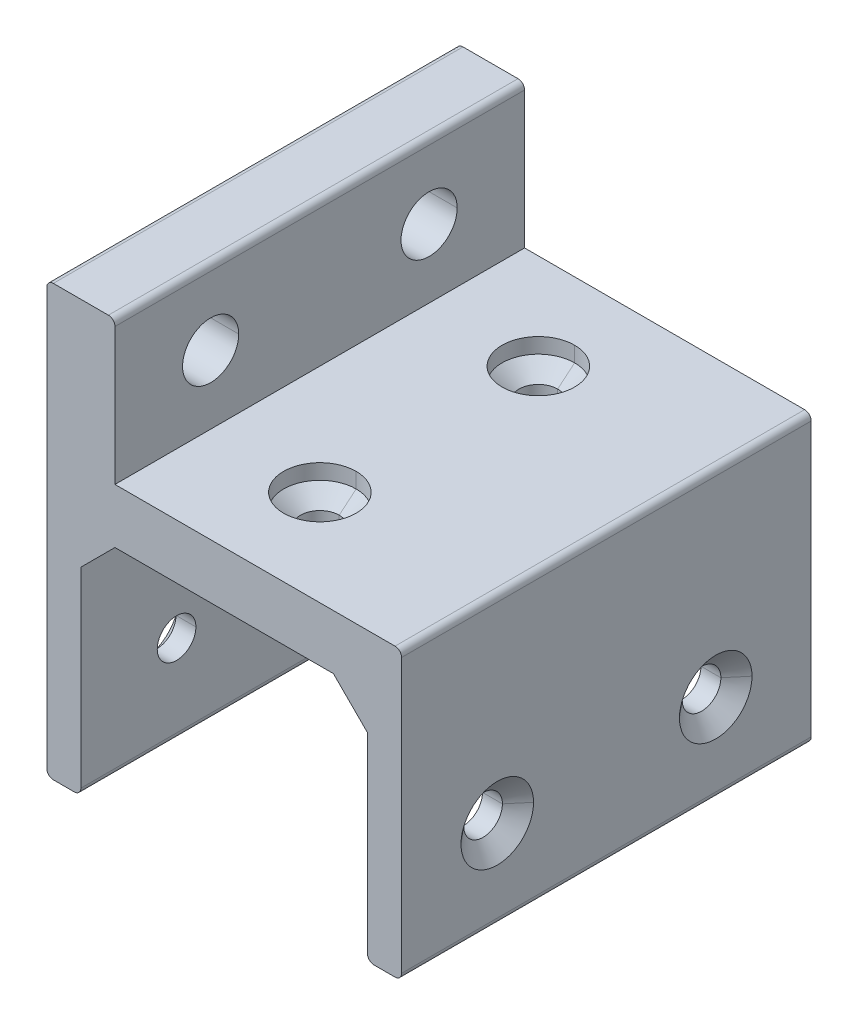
ISO-10303-21;
HEADER;
FILE_DESCRIPTION(('STEP AP214'),'2;1');
FILE_NAME('part.step','',(''),(''),'','','');
FILE_SCHEMA(('AUTOMOTIVE_DESIGN { 1 0 10303 214 1 1 1 1 }'));
ENDSEC;
DATA;
#1=APPLICATION_CONTEXT('core data for automotive mechanical design processes');
#2=APPLICATION_PROTOCOL_DEFINITION('international standard','automotive_design',2000,#1);
#3=PRODUCT_CONTEXT('',#1,'mechanical');
#4=PRODUCT('Part','Part','',(#3));
#5=PRODUCT_RELATED_PRODUCT_CATEGORY('part','',(#4));
#6=PRODUCT_DEFINITION_FORMATION('','',#4);
#7=PRODUCT_DEFINITION_CONTEXT('part definition',#1,'design');
#8=PRODUCT_DEFINITION('design','',#6,#7);
#9=PRODUCT_DEFINITION_SHAPE('','',#8);
#10=(LENGTH_UNIT() NAMED_UNIT(*) SI_UNIT(.MILLI.,.METRE.));
#11=(NAMED_UNIT(*) PLANE_ANGLE_UNIT() SI_UNIT($,.RADIAN.));
#12=(NAMED_UNIT(*) SI_UNIT($,.STERADIAN.) SOLID_ANGLE_UNIT());
#13=UNCERTAINTY_MEASURE_WITH_UNIT(LENGTH_MEASURE(1.E-05),#10,'distance_accuracy_value','');
#14=(GEOMETRIC_REPRESENTATION_CONTEXT(3) GLOBAL_UNCERTAINTY_ASSIGNED_CONTEXT((#13)) GLOBAL_UNIT_ASSIGNED_CONTEXT((#10,
#11,#12)) REPRESENTATION_CONTEXT('',''));
#15=CARTESIAN_POINT('',(0.,0.,0.));
#16=DIRECTION('',(0.,0.,1.));
#17=DIRECTION('',(1.,0.,0.));
#18=AXIS2_PLACEMENT_3D('',#15,#16,#17);
#19=CARTESIAN_POINT('',(16.6624,12.7,23.8125));
#20=DIRECTION('',(1.,0.,0.));
#21=DIRECTION('',(0.,0.,-1.));
#22=AXIS2_PLACEMENT_3D('',#19,#20,#21);
#23=PLANE('',#22);
#24=CARTESIAN_POINT('',(16.6624,0.,-12.7127));
#25=DIRECTION('',(1.,0.,0.));
#26=DIRECTION('',(0.,0.,-1.));
#27=AXIS2_PLACEMENT_3D('',#24,#25,#26);
#28=CIRCLE('',#27,2.2479);
#29=CARTESIAN_POINT('',(16.6624,0.,-14.9606));
#30=VERTEX_POINT('',#29);
#31=CARTESIAN_POINT('',(16.6624,0.,-10.4648));
#32=VERTEX_POINT('',#31);
#33=EDGE_CURVE('E11',#30,#32,#28,.T.);
#34=ORIENTED_EDGE('',*,*,#33,.T.);
#35=CARTESIAN_POINT('',(16.6624,0.,-12.7127));
#36=DIRECTION('',(1.,0.,0.));
#37=DIRECTION('',(0.,0.,-1.));
#38=AXIS2_PLACEMENT_3D('',#35,#36,#37);
#39=CIRCLE('',#38,2.2479);
#40=EDGE_CURVE('E25',#32,#30,#39,.T.);
#41=ORIENTED_EDGE('',*,*,#40,.T.);
#42=EDGE_LOOP('',(#34,#41));
#43=FACE_BOUND('',#42,.T.);
#44=CARTESIAN_POINT('',(16.6624,0.,12.6873));
#45=DIRECTION('',(1.,0.,0.));
#46=DIRECTION('',(0.,0.,-1.));
#47=AXIS2_PLACEMENT_3D('',#44,#45,#46);
#48=CIRCLE('',#47,2.2479);
#49=CARTESIAN_POINT('',(16.6624,0.,10.4394));
#50=VERTEX_POINT('',#49);
#51=CARTESIAN_POINT('',(16.6624,0.,14.9352));
#52=VERTEX_POINT('',#51);
#53=EDGE_CURVE('E1600',#50,#52,#48,.T.);
#54=ORIENTED_EDGE('',*,*,#53,.T.);
#55=CARTESIAN_POINT('',(16.6624,0.,12.6873));
#56=DIRECTION('',(1.,0.,0.));
#57=DIRECTION('',(0.,0.,-1.));
#58=AXIS2_PLACEMENT_3D('',#55,#56,#57);
#59=CIRCLE('',#58,2.2479);
#60=EDGE_CURVE('E1596',#52,#50,#59,.T.);
#61=ORIENTED_EDGE('',*,*,#60,.T.);
#62=EDGE_LOOP('',(#54,#61));
#63=FACE_BOUND('',#62,.T.);
#64=DIRECTION('',(0.,-1.,0.));
#65=VECTOR('',#64,1.);
#66=CARTESIAN_POINT('',(16.6624,12.7,-23.8125));
#67=LINE('',#66,#65);
#68=CARTESIAN_POINT('',(16.6624,12.7,-23.8125));
#69=VERTEX_POINT('',#68);
#70=CARTESIAN_POINT('',(16.6624,-9.5504,-23.8125));
#71=VERTEX_POINT('',#70);
#72=EDGE_CURVE('E1592',#69,#71,#67,.T.);
#73=ORIENTED_EDGE('',*,*,#72,.T.);
#74=DIRECTION('',(0.,0.,-1.));
#75=VECTOR('',#74,1.);
#76=CARTESIAN_POINT('',(16.6624,-9.5504,23.8125));
#77=LINE('',#76,#75);
#78=CARTESIAN_POINT('',(16.6624,-9.5504,23.8125));
#79=VERTEX_POINT('',#78);
#80=EDGE_CURVE('E1587',#79,#71,#77,.T.);
#81=ORIENTED_EDGE('',*,*,#80,.F.);
#82=DIRECTION('',(0.,-1.,0.));
#83=VECTOR('',#82,1.);
#84=CARTESIAN_POINT('',(16.6624,12.7,23.8125));
#85=LINE('',#84,#83);
#86=CARTESIAN_POINT('',(16.6624,12.7,23.8125));
#87=VERTEX_POINT('',#86);
#88=EDGE_CURVE('E1582',#87,#79,#85,.T.);
#89=ORIENTED_EDGE('',*,*,#88,.F.);
#90=DIRECTION('',(0.,0.,-1.));
#91=VECTOR('',#90,1.);
#92=CARTESIAN_POINT('',(16.6624,12.7,23.8125));
#93=LINE('',#92,#91);
#94=EDGE_CURVE('E1578',#87,#69,#93,.T.);
#95=ORIENTED_EDGE('',*,*,#94,.T.);
#96=EDGE_LOOP('',(#73,#81,#89,#95));
#97=FACE_BOUND('',#96,.T.);
#98=ADVANCED_FACE('F17',(#43,#63,#97),#23,.F.);
#99=CARTESIAN_POINT('',(12.7,16.6624,23.8125));
#100=DIRECTION('',(0.707106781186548,0.707106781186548,0.));
#101=DIRECTION('',(-0.707106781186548,0.707106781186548,0.));
#102=AXIS2_PLACEMENT_3D('',#99,#100,#101);
#103=PLANE('',#102);
#104=DIRECTION('',(0.707106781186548,-0.707106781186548,0.));
#105=VECTOR('',#104,1.);
#106=CARTESIAN_POINT('',(12.7,16.6624,-23.8125));
#107=LINE('',#106,#105);
#108=CARTESIAN_POINT('',(12.7,16.6624,-23.8125));
#109=VERTEX_POINT('',#108);
#110=EDGE_CURVE('E1573',#109,#69,#107,.T.);
#111=ORIENTED_EDGE('',*,*,#110,.T.);
#112=ORIENTED_EDGE('',*,*,#94,.F.);
#113=DIRECTION('',(0.707106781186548,-0.707106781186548,0.));
#114=VECTOR('',#113,1.);
#115=CARTESIAN_POINT('',(12.7,16.6624,23.8125));
#116=LINE('',#115,#114);
#117=CARTESIAN_POINT('',(12.7,16.6624,23.8125));
#118=VERTEX_POINT('',#117);
#119=EDGE_CURVE('E1568',#118,#87,#116,.T.);
#120=ORIENTED_EDGE('',*,*,#119,.F.);
#121=DIRECTION('',(0.,0.,-1.));
#122=VECTOR('',#121,1.);
#123=CARTESIAN_POINT('',(12.7,16.6624,23.8125));
#124=LINE('',#123,#122);
#125=EDGE_CURVE('E1564',#118,#109,#124,.T.);
#126=ORIENTED_EDGE('',*,*,#125,.T.);
#127=EDGE_LOOP('',(#111,#112,#120,#126));
#128=FACE_BOUND('',#127,.T.);
#129=ADVANCED_FACE('F1623',(#128),#103,.F.);
#130=CARTESIAN_POINT('',(-12.7,16.6624,23.8125));
#131=DIRECTION('',(0.,1.,0.));
#132=DIRECTION('',(0.,0.,1.));
#133=AXIS2_PLACEMENT_3D('',#130,#131,#132);
#134=PLANE('',#133);
#135=CARTESIAN_POINT('',(0.,16.6624,-12.7127));
#136=DIRECTION('',(0.,-1.,0.));
#137=DIRECTION('',(0.,0.,-1.));
#138=AXIS2_PLACEMENT_3D('',#135,#136,#137);
#139=CIRCLE('',#138,2.2479);
#140=CARTESIAN_POINT('',(0.,16.6624,-14.9606));
#141=VERTEX_POINT('',#140);
#142=CARTESIAN_POINT('',(0.,16.6624,-10.4648));
#143=VERTEX_POINT('',#142);
#144=EDGE_CURVE('E1560',#141,#143,#139,.T.);
#145=ORIENTED_EDGE('',*,*,#144,.F.);
#146=CARTESIAN_POINT('',(0.,16.6624,-12.7127));
#147=DIRECTION('',(0.,-1.,0.));
#148=DIRECTION('',(0.,0.,-1.));
#149=AXIS2_PLACEMENT_3D('',#146,#147,#148);
#150=CIRCLE('',#149,2.2479);
#151=EDGE_CURVE('E1556',#143,#141,#150,.T.);
#152=ORIENTED_EDGE('',*,*,#151,.F.);
#153=EDGE_LOOP('',(#145,#152));
#154=FACE_BOUND('',#153,.T.);
#155=CARTESIAN_POINT('',(0.,16.6624,12.6873));
#156=DIRECTION('',(0.,-1.,0.));
#157=DIRECTION('',(0.,0.,-1.));
#158=AXIS2_PLACEMENT_3D('',#155,#156,#157);
#159=CIRCLE('',#158,2.2479);
#160=CARTESIAN_POINT('',(0.,16.6624,10.4394));
#161=VERTEX_POINT('',#160);
#162=CARTESIAN_POINT('',(0.,16.6624,14.9352));
#163=VERTEX_POINT('',#162);
#164=EDGE_CURVE('E1552',#161,#163,#159,.T.);
#165=ORIENTED_EDGE('',*,*,#164,.F.);
#166=CARTESIAN_POINT('',(0.,16.6624,12.6873));
#167=DIRECTION('',(0.,-1.,0.));
#168=DIRECTION('',(0.,0.,-1.));
#169=AXIS2_PLACEMENT_3D('',#166,#167,#168);
#170=CIRCLE('',#169,2.2479);
#171=EDGE_CURVE('E1548',#163,#161,#170,.T.);
#172=ORIENTED_EDGE('',*,*,#171,.F.);
#173=EDGE_LOOP('',(#165,#172));
#174=FACE_BOUND('',#173,.T.);
#175=DIRECTION('',(1.,0.,0.));
#176=VECTOR('',#175,1.);
#177=CARTESIAN_POINT('',(-12.7,16.6624,-23.8125));
#178=LINE('',#177,#176);
#179=CARTESIAN_POINT('',(-12.7,16.6624,-23.8125));
#180=VERTEX_POINT('',#179);
#181=EDGE_CURVE('E1543',#180,#109,#178,.T.);
#182=ORIENTED_EDGE('',*,*,#181,.T.);
#183=ORIENTED_EDGE('',*,*,#125,.F.);
#184=DIRECTION('',(1.,0.,0.));
#185=VECTOR('',#184,1.);
#186=CARTESIAN_POINT('',(-12.7,16.6624,23.8125));
#187=LINE('',#186,#185);
#188=CARTESIAN_POINT('',(-12.7,16.6624,23.8125));
#189=VERTEX_POINT('',#188);
#190=EDGE_CURVE('E1538',#189,#118,#187,.T.);
#191=ORIENTED_EDGE('',*,*,#190,.F.);
#192=DIRECTION('',(0.,0.,-1.));
#193=VECTOR('',#192,1.);
#194=CARTESIAN_POINT('',(-12.7,16.6624,23.8125));
#195=LINE('',#194,#193);
#196=EDGE_CURVE('E1534',#189,#180,#195,.T.);
#197=ORIENTED_EDGE('',*,*,#196,.T.);
#198=EDGE_LOOP('',(#182,#183,#191,#197));
#199=FACE_BOUND('',#198,.T.);
#200=ADVANCED_FACE('F1627',(#154,#174,#199),#134,.F.);
#201=CARTESIAN_POINT('',(-16.6624,12.7,23.8125));
#202=DIRECTION('',(-0.707106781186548,0.707106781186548,0.));
#203=DIRECTION('',(-0.707106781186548,-0.707106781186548,0.));
#204=AXIS2_PLACEMENT_3D('',#201,#202,#203);
#205=PLANE('',#204);
#206=DIRECTION('',(0.707106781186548,0.707106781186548,0.));
#207=VECTOR('',#206,1.);
#208=CARTESIAN_POINT('',(-16.6624,12.7,-23.8125));
#209=LINE('',#208,#207);
#210=CARTESIAN_POINT('',(-16.6624,12.7,-23.8125));
#211=VERTEX_POINT('',#210);
#212=EDGE_CURVE('E1529',#211,#180,#209,.T.);
#213=ORIENTED_EDGE('',*,*,#212,.T.);
#214=ORIENTED_EDGE('',*,*,#196,.F.);
#215=DIRECTION('',(0.707106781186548,0.707106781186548,0.));
#216=VECTOR('',#215,1.);
#217=CARTESIAN_POINT('',(-16.6624,12.7,23.8125));
#218=LINE('',#217,#216);
#219=CARTESIAN_POINT('',(-16.6624,12.7,23.8125));
#220=VERTEX_POINT('',#219);
#221=EDGE_CURVE('E1524',#220,#189,#218,.T.);
#222=ORIENTED_EDGE('',*,*,#221,.F.);
#223=DIRECTION('',(0.,0.,-1.));
#224=VECTOR('',#223,1.);
#225=CARTESIAN_POINT('',(-16.6624,12.7,23.8125));
#226=LINE('',#225,#224);
#227=EDGE_CURVE('E1520',#220,#211,#226,.T.);
#228=ORIENTED_EDGE('',*,*,#227,.T.);
#229=EDGE_LOOP('',(#213,#214,#222,#228));
#230=FACE_BOUND('',#229,.T.);
#231=ADVANCED_FACE('F1632',(#230),#205,.F.);
#232=CARTESIAN_POINT('',(-16.6624,-9.5504,23.8125));
#233=DIRECTION('',(-1.,0.,0.));
#234=DIRECTION('',(0.,0.,1.));
#235=AXIS2_PLACEMENT_3D('',#232,#233,#234);
#236=PLANE('',#235);
#237=CARTESIAN_POINT('',(-16.6624,0.,-12.7127));
#238=DIRECTION('',(-1.,0.,0.));
#239=DIRECTION('',(0.,0.,1.));
#240=AXIS2_PLACEMENT_3D('',#237,#238,#239);
#241=CIRCLE('',#240,2.2479);
#242=CARTESIAN_POINT('',(-16.6624,0.,-10.4648));
#243=VERTEX_POINT('',#242);
#244=CARTESIAN_POINT('',(-16.6624,0.,-14.9606));
#245=VERTEX_POINT('',#244);
#246=EDGE_CURVE('E1516',#243,#245,#241,.T.);
#247=ORIENTED_EDGE('',*,*,#246,.T.);
#248=CARTESIAN_POINT('',(-16.6624,0.,-12.7127));
#249=DIRECTION('',(-1.,0.,0.));
#250=DIRECTION('',(0.,0.,1.));
#251=AXIS2_PLACEMENT_3D('',#248,#249,#250);
#252=CIRCLE('',#251,2.2479);
#253=EDGE_CURVE('E323',#245,#243,#252,.T.);
#254=ORIENTED_EDGE('',*,*,#253,.T.);
#255=EDGE_LOOP('',(#247,#254));
#256=FACE_BOUND('',#255,.T.);
#257=CARTESIAN_POINT('',(-16.6624,0.,12.6873));
#258=DIRECTION('',(-1.,0.,0.));
#259=DIRECTION('',(0.,0.,1.));
#260=AXIS2_PLACEMENT_3D('',#257,#258,#259);
#261=CIRCLE('',#260,2.2479);
#262=CARTESIAN_POINT('',(-16.6624,0.,14.9352));
#263=VERTEX_POINT('',#262);
#264=CARTESIAN_POINT('',(-16.6624,0.,10.4394));
#265=VERTEX_POINT('',#264);
#266=EDGE_CURVE('E1509',#263,#265,#261,.T.);
#267=ORIENTED_EDGE('',*,*,#266,.T.);
#268=CARTESIAN_POINT('',(-16.6624,0.,12.6873));
#269=DIRECTION('',(-1.,0.,0.));
#270=DIRECTION('',(0.,0.,1.));
#271=AXIS2_PLACEMENT_3D('',#268,#269,#270);
#272=CIRCLE('',#271,2.2479);
#273=EDGE_CURVE('E1505',#265,#263,#272,.T.);
#274=ORIENTED_EDGE('',*,*,#273,.T.);
#275=EDGE_LOOP('',(#267,#274));
#276=FACE_BOUND('',#275,.T.);
#277=DIRECTION('',(0.,1.,0.));
#278=VECTOR('',#277,1.);
#279=CARTESIAN_POINT('',(-16.6624,-9.5504,-23.8125));
#280=LINE('',#279,#278);
#281=CARTESIAN_POINT('',(-16.6624,-9.55039999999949,-23.8125));
#282=VERTEX_POINT('',#281);
#283=EDGE_CURVE('E1500',#282,#211,#280,.T.);
#284=ORIENTED_EDGE('',*,*,#283,.T.);
#285=ORIENTED_EDGE('',*,*,#227,.F.);
#286=DIRECTION('',(0.,1.,0.));
#287=VECTOR('',#286,1.);
#288=CARTESIAN_POINT('',(-16.6624,-9.5504,23.8125));
#289=LINE('',#288,#287);
#290=CARTESIAN_POINT('',(-16.6624,-9.55039999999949,23.8125));
#291=VERTEX_POINT('',#290);
#292=EDGE_CURVE('E1495',#291,#220,#289,.T.);
#293=ORIENTED_EDGE('',*,*,#292,.F.);
#294=DIRECTION('',(0.,0.,-1.));
#295=VECTOR('',#294,1.);
#296=CARTESIAN_POINT('',(-16.6624,-9.55039999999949,23.8125));
#297=LINE('',#296,#295);
#298=EDGE_CURVE('E1491',#291,#282,#297,.T.);
#299=ORIENTED_EDGE('',*,*,#298,.T.);
#300=EDGE_LOOP('',(#284,#285,#293,#299));
#301=FACE_BOUND('',#300,.T.);
#302=ADVANCED_FACE('F1638',(#256,#276,#301),#236,.F.);
#303=CARTESIAN_POINT('',(-17.4244000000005,-9.55039999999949,23.8125));
#304=DIRECTION('',(0.,0.,1.));
#305=DIRECTION('',(-0.707106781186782,0.707106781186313,0.));
#306=AXIS2_PLACEMENT_3D('',#303,#304,#305);
#307=CYLINDRICAL_SURFACE('',#306,0.762000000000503);
#308=CARTESIAN_POINT('',(-17.4244000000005,-9.55039999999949,-23.8125));
#309=DIRECTION('',(0.,0.,1.));
#310=DIRECTION('',(1.,0.,0.));
#311=AXIS2_PLACEMENT_3D('',#308,#309,#310);
#312=CIRCLE('',#311,0.762000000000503);
#313=CARTESIAN_POINT('',(-17.4244,-10.3124,-23.8125));
#314=VERTEX_POINT('',#313);
#315=EDGE_CURVE('E1486',#314,#282,#312,.T.);
#316=ORIENTED_EDGE('',*,*,#315,.T.);
#317=ORIENTED_EDGE('',*,*,#298,.F.);
#318=CARTESIAN_POINT('',(-17.4244000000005,-9.55039999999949,23.8125));
#319=DIRECTION('',(0.,0.,1.));
#320=DIRECTION('',(1.,0.,0.));
#321=AXIS2_PLACEMENT_3D('',#318,#319,#320);
#322=CIRCLE('',#321,0.762000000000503);
#323=CARTESIAN_POINT('',(-17.4244,-10.3124,23.8125));
#324=VERTEX_POINT('',#323);
#325=EDGE_CURVE('E1481',#324,#291,#322,.T.);
#326=ORIENTED_EDGE('',*,*,#325,.F.);
#327=DIRECTION('',(0.,0.,-1.));
#328=VECTOR('',#327,1.);
#329=CARTESIAN_POINT('',(-17.4244,-10.3124,23.8125));
#330=LINE('',#329,#328);
#331=EDGE_CURVE('E1477',#324,#314,#330,.T.);
#332=ORIENTED_EDGE('',*,*,#331,.T.);
#333=EDGE_LOOP('',(#316,#317,#326,#332));
#334=FACE_BOUND('',#333,.T.);
#335=ADVANCED_FACE('F1642',(#334),#307,.T.);
#336=CARTESIAN_POINT('',(-19.8628,-10.3124,23.8125));
#337=DIRECTION('',(0.,1.,0.));
#338=DIRECTION('',(0.,0.,1.));
#339=AXIS2_PLACEMENT_3D('',#336,#337,#338);
#340=PLANE('',#339);
#341=DIRECTION('',(1.,0.,0.));
#342=VECTOR('',#341,1.);
#343=CARTESIAN_POINT('',(-19.8628,-10.3124,-23.8125));
#344=LINE('',#343,#342);
#345=CARTESIAN_POINT('',(-19.8627999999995,-10.3124,-23.8125));
#346=VERTEX_POINT('',#345);
#347=EDGE_CURVE('E1472',#346,#314,#344,.T.);
#348=ORIENTED_EDGE('',*,*,#347,.T.);
#349=ORIENTED_EDGE('',*,*,#331,.F.);
#350=DIRECTION('',(1.,0.,0.));
#351=VECTOR('',#350,1.);
#352=CARTESIAN_POINT('',(-19.8628,-10.3124,23.8125));
#353=LINE('',#352,#351);
#354=CARTESIAN_POINT('',(-19.8627999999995,-10.3124,23.8125));
#355=VERTEX_POINT('',#354);
#356=EDGE_CURVE('E1467',#355,#324,#353,.T.);
#357=ORIENTED_EDGE('',*,*,#356,.F.);
#358=DIRECTION('',(0.,0.,-1.));
#359=VECTOR('',#358,1.);
#360=CARTESIAN_POINT('',(-19.8627999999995,-10.3124,23.8125));
#361=LINE('',#360,#359);
#362=EDGE_CURVE('E1463',#355,#346,#361,.T.);
#363=ORIENTED_EDGE('',*,*,#362,.T.);
#364=EDGE_LOOP('',(#348,#349,#357,#363));
#365=FACE_BOUND('',#364,.T.);
#366=ADVANCED_FACE('F1646',(#365),#340,.F.);
#367=CARTESIAN_POINT('',(-19.8627999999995,-9.55039999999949,23.8125));
#368=DIRECTION('',(0.,0.,1.));
#369=DIRECTION('',(0.70710678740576,0.707106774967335,0.));
#370=AXIS2_PLACEMENT_3D('',#367,#368,#369);
#371=CYLINDRICAL_SURFACE('',#370,0.762000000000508);
#372=CARTESIAN_POINT('',(-19.8627999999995,-9.55039999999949,-23.8125));
#373=DIRECTION('',(0.,0.,1.));
#374=DIRECTION('',(1.,0.,0.));
#375=AXIS2_PLACEMENT_3D('',#372,#373,#374);
#376=CIRCLE('',#375,0.762000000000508);
#377=CARTESIAN_POINT('',(-20.6248,-9.5503999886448,-23.8125));
#378=VERTEX_POINT('',#377);
#379=EDGE_CURVE('E1458',#378,#346,#376,.T.);
#380=ORIENTED_EDGE('',*,*,#379,.T.);
#381=ORIENTED_EDGE('',*,*,#362,.F.);
#382=CARTESIAN_POINT('',(-19.8627999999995,-9.55039999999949,23.8125));
#383=DIRECTION('',(0.,0.,1.));
#384=DIRECTION('',(1.,0.,0.));
#385=AXIS2_PLACEMENT_3D('',#382,#383,#384);
#386=CIRCLE('',#385,0.762000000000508);
#387=CARTESIAN_POINT('',(-20.6248,-9.5503999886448,23.8125));
#388=VERTEX_POINT('',#387);
#389=EDGE_CURVE('E1453',#388,#355,#386,.T.);
#390=ORIENTED_EDGE('',*,*,#389,.F.);
#391=DIRECTION('',(0.,0.,-1.));
#392=VECTOR('',#391,1.);
#393=CARTESIAN_POINT('',(-20.6248,-9.5503999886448,23.8125));
#394=LINE('',#393,#392);
#395=EDGE_CURVE('E1449',#388,#378,#394,.T.);
#396=ORIENTED_EDGE('',*,*,#395,.T.);
#397=EDGE_LOOP('',(#380,#381,#390,#396));
#398=FACE_BOUND('',#397,.T.);
#399=ADVANCED_FACE('F1650',(#398),#371,.T.);
#400=CARTESIAN_POINT('',(-20.6248,38.9128,23.8125));
#401=DIRECTION('',(1.,0.,0.));
#402=DIRECTION('',(0.,0.,-1.));
#403=AXIS2_PLACEMENT_3D('',#400,#401,#402);
#404=PLANE('',#403);
#405=CARTESIAN_POINT('',(-20.6248,0.,-12.7127));
#406=DIRECTION('',(1.,0.,0.));
#407=DIRECTION('',(0.,0.,-1.));
#408=AXIS2_PLACEMENT_3D('',#405,#406,#407);
#409=CIRCLE('',#408,4.2164);
#410=CARTESIAN_POINT('',(-20.6248,0.,-16.9291));
#411=VERTEX_POINT('',#410);
#412=CARTESIAN_POINT('',(-20.6248,0.,-8.4963));
#413=VERTEX_POINT('',#412);
#414=EDGE_CURVE('E308',#411,#413,#409,.T.);
#415=ORIENTED_EDGE('',*,*,#414,.T.);
#416=CARTESIAN_POINT('',(-20.6248,0.,-12.7127));
#417=DIRECTION('',(1.,0.,0.));
#418=DIRECTION('',(0.,0.,-1.));
#419=AXIS2_PLACEMENT_3D('',#416,#417,#418);
#420=CIRCLE('',#419,4.2164);
#421=EDGE_CURVE('E1442',#413,#411,#420,.T.);
#422=ORIENTED_EDGE('',*,*,#421,.T.);
#423=EDGE_LOOP('',(#415,#422));
#424=FACE_BOUND('',#423,.T.);
#425=CARTESIAN_POINT('',(-20.6248,0.,12.6873));
#426=DIRECTION('',(1.,0.,0.));
#427=DIRECTION('',(0.,0.,-1.));
#428=AXIS2_PLACEMENT_3D('',#425,#426,#427);
#429=CIRCLE('',#428,4.2164);
#430=CARTESIAN_POINT('',(-20.6248,0.,8.4709));
#431=VERTEX_POINT('',#430);
#432=CARTESIAN_POINT('',(-20.6248,0.,16.9037));
#433=VERTEX_POINT('',#432);
#434=EDGE_CURVE('E1438',#431,#433,#429,.T.);
#435=ORIENTED_EDGE('',*,*,#434,.T.);
#436=CARTESIAN_POINT('',(-20.6248,0.,12.6873));
#437=DIRECTION('',(1.,0.,0.));
#438=DIRECTION('',(0.,0.,-1.));
#439=AXIS2_PLACEMENT_3D('',#436,#437,#438);
#440=CIRCLE('',#439,4.2164);
#441=EDGE_CURVE('E1434',#433,#431,#440,.T.);
#442=ORIENTED_EDGE('',*,*,#441,.T.);
#443=EDGE_LOOP('',(#435,#442));
#444=FACE_BOUND('',#443,.T.);
#445=CARTESIAN_POINT('',(-20.6248,30.9626,-12.7127));
#446=DIRECTION('',(1.,0.,0.));
#447=DIRECTION('',(0.,0.,-1.));
#448=AXIS2_PLACEMENT_3D('',#445,#446,#447);
#449=CIRCLE('',#448,3.2639);
#450=CARTESIAN_POINT('',(-20.6248,30.9626,-15.9766));
#451=VERTEX_POINT('',#450);
#452=CARTESIAN_POINT('',(-20.6248,30.9626,-9.4488));
#453=VERTEX_POINT('',#452);
#454=EDGE_CURVE('E1430',#451,#453,#449,.T.);
#455=ORIENTED_EDGE('',*,*,#454,.T.);
#456=CARTESIAN_POINT('',(-20.6248,30.9626,-12.7127));
#457=DIRECTION('',(1.,0.,0.));
#458=DIRECTION('',(0.,0.,-1.));
#459=AXIS2_PLACEMENT_3D('',#456,#457,#458);
#460=CIRCLE('',#459,3.2639);
#461=EDGE_CURVE('E1426',#453,#451,#460,.T.);
#462=ORIENTED_EDGE('',*,*,#461,.T.);
#463=EDGE_LOOP('',(#455,#462));
#464=FACE_BOUND('',#463,.T.);
#465=CARTESIAN_POINT('',(-20.6248,30.9626,12.6873));
#466=DIRECTION('',(1.,0.,0.));
#467=DIRECTION('',(0.,0.,-1.));
#468=AXIS2_PLACEMENT_3D('',#465,#466,#467);
#469=CIRCLE('',#468,3.2639);
#470=CARTESIAN_POINT('',(-20.6248,30.9626,9.4234));
#471=VERTEX_POINT('',#470);
#472=CARTESIAN_POINT('',(-20.6248,30.9626,15.9512));
#473=VERTEX_POINT('',#472);
#474=EDGE_CURVE('E1422',#471,#473,#469,.T.);
#475=ORIENTED_EDGE('',*,*,#474,.T.);
#476=CARTESIAN_POINT('',(-20.6248,30.9626,12.6873));
#477=DIRECTION('',(1.,0.,0.));
#478=DIRECTION('',(0.,0.,-1.));
#479=AXIS2_PLACEMENT_3D('',#476,#477,#478);
#480=CIRCLE('',#479,3.2639);
#481=EDGE_CURVE('E1418',#473,#471,#480,.T.);
#482=ORIENTED_EDGE('',*,*,#481,.T.);
#483=EDGE_LOOP('',(#475,#482));
#484=FACE_BOUND('',#483,.T.);
#485=DIRECTION('',(0.,-1.,0.));
#486=VECTOR('',#485,1.);
#487=CARTESIAN_POINT('',(-20.6248,38.9128,-23.8125));
#488=LINE('',#487,#486);
#489=CARTESIAN_POINT('',(-20.6248,38.9128000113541,-23.8125));
#490=VERTEX_POINT('',#489);
#491=EDGE_CURVE('E1413',#490,#378,#488,.T.);
#492=ORIENTED_EDGE('',*,*,#491,.T.);
#493=ORIENTED_EDGE('',*,*,#395,.F.);
#494=DIRECTION('',(0.,-1.,0.));
#495=VECTOR('',#494,1.);
#496=CARTESIAN_POINT('',(-20.6248,38.9128,23.8125));
#497=LINE('',#496,#495);
#498=CARTESIAN_POINT('',(-20.6248,38.9128000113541,23.8125));
#499=VERTEX_POINT('',#498);
#500=EDGE_CURVE('E1408',#499,#388,#497,.T.);
#501=ORIENTED_EDGE('',*,*,#500,.F.);
#502=DIRECTION('',(0.,0.,-1.));
#503=VECTOR('',#502,1.);
#504=CARTESIAN_POINT('',(-20.6248,38.9128000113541,23.8125));
#505=LINE('',#504,#503);
#506=EDGE_CURVE('E1404',#499,#490,#505,.T.);
#507=ORIENTED_EDGE('',*,*,#506,.T.);
#508=EDGE_LOOP('',(#492,#493,#501,#507));
#509=FACE_BOUND('',#508,.T.);
#510=ADVANCED_FACE('F1654',(#424,#444,#464,#484,#509),#404,.F.);
#511=CARTESIAN_POINT('',(-19.8627999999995,38.9127999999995,23.8125));
#512=DIRECTION('',(0.,0.,1.));
#513=DIRECTION('',(0.707106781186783,-0.707106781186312,0.));
#514=AXIS2_PLACEMENT_3D('',#511,#512,#513);
#515=CYLINDRICAL_SURFACE('',#514,0.762000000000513);
#516=CARTESIAN_POINT('',(-19.8627999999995,38.9127999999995,-23.8125));
#517=DIRECTION('',(0.,0.,1.));
#518=DIRECTION('',(1.,0.,0.));
#519=AXIS2_PLACEMENT_3D('',#516,#517,#518);
#520=CIRCLE('',#519,0.762000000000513);
#521=CARTESIAN_POINT('',(-19.8628,39.6748,-23.8125));
#522=VERTEX_POINT('',#521);
#523=EDGE_CURVE('E1399',#522,#490,#520,.T.);
#524=ORIENTED_EDGE('',*,*,#523,.T.);
#525=ORIENTED_EDGE('',*,*,#506,.F.);
#526=CARTESIAN_POINT('',(-19.8627999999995,38.9127999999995,23.8125));
#527=DIRECTION('',(0.,0.,1.));
#528=DIRECTION('',(1.,0.,0.));
#529=AXIS2_PLACEMENT_3D('',#526,#527,#528);
#530=CIRCLE('',#529,0.762000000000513);
#531=CARTESIAN_POINT('',(-19.8628,39.6748,23.8125));
#532=VERTEX_POINT('',#531);
#533=EDGE_CURVE('E1394',#532,#499,#530,.T.);
#534=ORIENTED_EDGE('',*,*,#533,.F.);
#535=DIRECTION('',(0.,0.,-1.));
#536=VECTOR('',#535,1.);
#537=CARTESIAN_POINT('',(-19.8628,39.6748,23.8125));
#538=LINE('',#537,#536);
#539=EDGE_CURVE('E1390',#532,#522,#538,.T.);
#540=ORIENTED_EDGE('',*,*,#539,.T.);
#541=EDGE_LOOP('',(#524,#525,#534,#540));
#542=FACE_BOUND('',#541,.T.);
#543=ADVANCED_FACE('F1658',(#542),#515,.T.);
#544=CARTESIAN_POINT('',(-13.462,39.6748,23.8125));
#545=DIRECTION('',(0.,-1.,0.));
#546=DIRECTION('',(0.,0.,-1.));
#547=AXIS2_PLACEMENT_3D('',#544,#545,#546);
#548=PLANE('',#547);
#549=DIRECTION('',(-1.,0.,0.));
#550=VECTOR('',#549,1.);
#551=CARTESIAN_POINT('',(-13.462,39.6748,-23.8125));
#552=LINE('',#551,#550);
#553=CARTESIAN_POINT('',(-13.4620000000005,39.6748,-23.8125));
#554=VERTEX_POINT('',#553);
#555=EDGE_CURVE('E1385',#554,#522,#552,.T.);
#556=ORIENTED_EDGE('',*,*,#555,.T.);
#557=ORIENTED_EDGE('',*,*,#539,.F.);
#558=DIRECTION('',(-1.,0.,0.));
#559=VECTOR('',#558,1.);
#560=CARTESIAN_POINT('',(-13.462,39.6748,23.8125));
#561=LINE('',#560,#559);
#562=CARTESIAN_POINT('',(-13.4620000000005,39.6748,23.8125));
#563=VERTEX_POINT('',#562);
#564=EDGE_CURVE('E1380',#563,#532,#561,.T.);
#565=ORIENTED_EDGE('',*,*,#564,.F.);
#566=DIRECTION('',(0.,0.,-1.));
#567=VECTOR('',#566,1.);
#568=CARTESIAN_POINT('',(-13.4620000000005,39.6748,23.8125));
#569=LINE('',#568,#567);
#570=EDGE_CURVE('E1376',#563,#554,#569,.T.);
#571=ORIENTED_EDGE('',*,*,#570,.T.);
#572=EDGE_LOOP('',(#556,#557,#565,#571));
#573=FACE_BOUND('',#572,.T.);
#574=ADVANCED_FACE('F1662',(#573),#548,.F.);
#575=CARTESIAN_POINT('',(-13.4620000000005,38.9127999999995,23.8125));
#576=DIRECTION('',(0.,0.,1.));
#577=DIRECTION('',(-0.707106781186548,-0.707106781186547,0.));
#578=AXIS2_PLACEMENT_3D('',#575,#576,#577);
#579=CYLINDRICAL_SURFACE('',#578,0.76200000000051);
#580=CARTESIAN_POINT('',(-13.4620000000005,38.9127999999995,-23.8125));
#581=DIRECTION('',(0.,0.,1.));
#582=DIRECTION('',(1.,0.,0.));
#583=AXIS2_PLACEMENT_3D('',#580,#581,#582);
#584=CIRCLE('',#583,0.76200000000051);
#585=CARTESIAN_POINT('',(-12.7,38.9128,-23.8125));
#586=VERTEX_POINT('',#585);
#587=EDGE_CURVE('E1371',#586,#554,#584,.T.);
#588=ORIENTED_EDGE('',*,*,#587,.T.);
#589=ORIENTED_EDGE('',*,*,#570,.F.);
#590=CARTESIAN_POINT('',(-13.4620000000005,38.9127999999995,23.8125));
#591=DIRECTION('',(0.,0.,1.));
#592=DIRECTION('',(1.,0.,0.));
#593=AXIS2_PLACEMENT_3D('',#590,#591,#592);
#594=CIRCLE('',#593,0.76200000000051);
#595=CARTESIAN_POINT('',(-12.7,38.9128,23.8125));
#596=VERTEX_POINT('',#595);
#597=EDGE_CURVE('E1366',#596,#563,#594,.T.);
#598=ORIENTED_EDGE('',*,*,#597,.F.);
#599=DIRECTION('',(0.,0.,-1.));
#600=VECTOR('',#599,1.);
#601=CARTESIAN_POINT('',(-12.7,38.9128,23.8125));
#602=LINE('',#601,#600);
#603=EDGE_CURVE('E1362',#596,#586,#602,.T.);
#604=ORIENTED_EDGE('',*,*,#603,.T.);
#605=EDGE_LOOP('',(#588,#589,#598,#604));
#606=FACE_BOUND('',#605,.T.);
#607=ADVANCED_FACE('F1666',(#606),#579,.T.);
#608=CARTESIAN_POINT('',(-12.7,23.0124,23.8125));
#609=DIRECTION('',(-1.,0.,0.));
#610=DIRECTION('',(0.,0.,1.));
#611=AXIS2_PLACEMENT_3D('',#608,#609,#610);
#612=PLANE('',#611);
#613=CARTESIAN_POINT('',(-12.7,30.9626,-12.7127));
#614=DIRECTION('',(1.,0.,0.));
#615=DIRECTION('',(0.,0.,-1.));
#616=AXIS2_PLACEMENT_3D('',#613,#614,#615);
#617=CIRCLE('',#616,3.2639);
#618=CARTESIAN_POINT('',(-12.7,30.9626,-15.9766));
#619=VERTEX_POINT('',#618);
#620=CARTESIAN_POINT('',(-12.7,30.9626,-9.4488));
#621=VERTEX_POINT('',#620);
#622=EDGE_CURVE('E1358',#619,#621,#617,.T.);
#623=ORIENTED_EDGE('',*,*,#622,.F.);
#624=CARTESIAN_POINT('',(-12.7,30.9626,-12.7127));
#625=DIRECTION('',(1.,0.,0.));
#626=DIRECTION('',(0.,0.,-1.));
#627=AXIS2_PLACEMENT_3D('',#624,#625,#626);
#628=CIRCLE('',#627,3.2639);
#629=EDGE_CURVE('E1354',#621,#619,#628,.T.);
#630=ORIENTED_EDGE('',*,*,#629,.F.);
#631=EDGE_LOOP('',(#623,#630));
#632=FACE_BOUND('',#631,.T.);
#633=CARTESIAN_POINT('',(-12.7,30.9626,12.6873));
#634=DIRECTION('',(1.,0.,0.));
#635=DIRECTION('',(0.,0.,-1.));
#636=AXIS2_PLACEMENT_3D('',#633,#634,#635);
#637=CIRCLE('',#636,3.2639);
#638=CARTESIAN_POINT('',(-12.7,30.9626,9.4234));
#639=VERTEX_POINT('',#638);
#640=CARTESIAN_POINT('',(-12.7,30.9626,15.9512));
#641=VERTEX_POINT('',#640);
#642=EDGE_CURVE('E1350',#639,#641,#637,.T.);
#643=ORIENTED_EDGE('',*,*,#642,.F.);
#644=CARTESIAN_POINT('',(-12.7,30.9626,12.6873));
#645=DIRECTION('',(1.,0.,0.));
#646=DIRECTION('',(0.,0.,-1.));
#647=AXIS2_PLACEMENT_3D('',#644,#645,#646);
#648=CIRCLE('',#647,3.2639);
#649=EDGE_CURVE('E1346',#641,#639,#648,.T.);
#650=ORIENTED_EDGE('',*,*,#649,.F.);
#651=EDGE_LOOP('',(#643,#650));
#652=FACE_BOUND('',#651,.T.);
#653=DIRECTION('',(0.,1.,0.));
#654=VECTOR('',#653,1.);
#655=CARTESIAN_POINT('',(-12.7,23.0124,-23.8125));
#656=LINE('',#655,#654);
#657=CARTESIAN_POINT('',(-12.7,23.0124,-23.8125));
#658=VERTEX_POINT('',#657);
#659=EDGE_CURVE('E1341',#658,#586,#656,.T.);
#660=ORIENTED_EDGE('',*,*,#659,.T.);
#661=ORIENTED_EDGE('',*,*,#603,.F.);
#662=DIRECTION('',(0.,1.,0.));
#663=VECTOR('',#662,1.);
#664=CARTESIAN_POINT('',(-12.7,23.0124,23.8125));
#665=LINE('',#664,#663);
#666=CARTESIAN_POINT('',(-12.7,23.0124,23.8125));
#667=VERTEX_POINT('',#666);
#668=EDGE_CURVE('E1336',#667,#596,#665,.T.);
#669=ORIENTED_EDGE('',*,*,#668,.F.);
#670=DIRECTION('',(0.,0.,-1.));
#671=VECTOR('',#670,1.);
#672=CARTESIAN_POINT('',(-12.7,23.0124,23.8125));
#673=LINE('',#672,#671);
#674=EDGE_CURVE('E1332',#667,#658,#673,.T.);
#675=ORIENTED_EDGE('',*,*,#674,.T.);
#676=EDGE_LOOP('',(#660,#661,#669,#675));
#677=FACE_BOUND('',#676,.T.);
#678=ADVANCED_FACE('F1670',(#632,#652,#677),#612,.F.);
#679=CARTESIAN_POINT('',(19.8628,23.0124,23.8125));
#680=DIRECTION('',(0.,-1.,0.));
#681=DIRECTION('',(0.,0.,-1.));
#682=AXIS2_PLACEMENT_3D('',#679,#680,#681);
#683=PLANE('',#682);
#684=CARTESIAN_POINT('',(0.,23.0124,-12.7127));
#685=DIRECTION('',(0.,-1.,0.));
#686=DIRECTION('',(0.,0.,-1.));
#687=AXIS2_PLACEMENT_3D('',#684,#685,#686);
#688=CIRCLE('',#687,4.2164);
#689=CARTESIAN_POINT('',(0.,23.0124,-16.9291));
#690=VERTEX_POINT('',#689);
#691=CARTESIAN_POINT('',(0.,23.0124,-8.4963));
#692=VERTEX_POINT('',#691);
#693=EDGE_CURVE('E1328',#690,#692,#688,.T.);
#694=ORIENTED_EDGE('',*,*,#693,.T.);
#695=CARTESIAN_POINT('',(0.,23.0124,-12.7127));
#696=DIRECTION('',(0.,-1.,0.));
#697=DIRECTION('',(0.,0.,-1.));
#698=AXIS2_PLACEMENT_3D('',#695,#696,#697);
#699=CIRCLE('',#698,4.2164);
#700=EDGE_CURVE('E1324',#692,#690,#699,.T.);
#701=ORIENTED_EDGE('',*,*,#700,.T.);
#702=EDGE_LOOP('',(#694,#701));
#703=FACE_BOUND('',#702,.T.);
#704=CARTESIAN_POINT('',(0.,23.0124,12.6873));
#705=DIRECTION('',(0.,-1.,0.));
#706=DIRECTION('',(0.,0.,-1.));
#707=AXIS2_PLACEMENT_3D('',#704,#705,#706);
#708=CIRCLE('',#707,4.2164);
#709=CARTESIAN_POINT('',(0.,23.0124,8.4709));
#710=VERTEX_POINT('',#709);
#711=CARTESIAN_POINT('',(0.,23.0124,16.9037));
#712=VERTEX_POINT('',#711);
#713=EDGE_CURVE('E1320',#710,#712,#708,.T.);
#714=ORIENTED_EDGE('',*,*,#713,.T.);
#715=CARTESIAN_POINT('',(0.,23.0124,12.6873));
#716=DIRECTION('',(0.,-1.,0.));
#717=DIRECTION('',(0.,0.,-1.));
#718=AXIS2_PLACEMENT_3D('',#715,#716,#717);
#719=CIRCLE('',#718,4.2164);
#720=EDGE_CURVE('E1316',#712,#710,#719,.T.);
#721=ORIENTED_EDGE('',*,*,#720,.T.);
#722=EDGE_LOOP('',(#714,#721));
#723=FACE_BOUND('',#722,.T.);
#724=DIRECTION('',(-1.,0.,0.));
#725=VECTOR('',#724,1.);
#726=CARTESIAN_POINT('',(19.8628,23.0124,-23.8125));
#727=LINE('',#726,#725);
#728=CARTESIAN_POINT('',(19.8627999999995,23.0124,-23.8125));
#729=VERTEX_POINT('',#728);
#730=EDGE_CURVE('E1311',#729,#658,#727,.T.);
#731=ORIENTED_EDGE('',*,*,#730,.T.);
#732=ORIENTED_EDGE('',*,*,#674,.F.);
#733=DIRECTION('',(-1.,0.,0.));
#734=VECTOR('',#733,1.);
#735=CARTESIAN_POINT('',(19.8628,23.0124,23.8125));
#736=LINE('',#735,#734);
#737=CARTESIAN_POINT('',(19.8627999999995,23.0124,23.8125));
#738=VERTEX_POINT('',#737);
#739=EDGE_CURVE('E1306',#738,#667,#736,.T.);
#740=ORIENTED_EDGE('',*,*,#739,.F.);
#741=DIRECTION('',(0.,0.,-1.));
#742=VECTOR('',#741,1.);
#743=CARTESIAN_POINT('',(19.8627999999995,23.0124,23.8125));
#744=LINE('',#743,#742);
#745=EDGE_CURVE('E1302',#738,#729,#744,.T.);
#746=ORIENTED_EDGE('',*,*,#745,.T.);
#747=EDGE_LOOP('',(#731,#732,#740,#746));
#748=FACE_BOUND('',#747,.T.);
#749=ADVANCED_FACE('F1674',(#703,#723,#748),#683,.F.);
#750=CARTESIAN_POINT('',(19.8627999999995,22.2503999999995,23.8125));
#751=DIRECTION('',(0.,0.,1.));
#752=DIRECTION('',(-0.707106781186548,-0.707106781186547,0.));
#753=AXIS2_PLACEMENT_3D('',#750,#751,#752);
#754=CYLINDRICAL_SURFACE('',#753,0.762000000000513);
#755=CARTESIAN_POINT('',(19.8627999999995,22.2503999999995,-23.8125));
#756=DIRECTION('',(0.,0.,1.));
#757=DIRECTION('',(1.,0.,0.));
#758=AXIS2_PLACEMENT_3D('',#755,#756,#757);
#759=CIRCLE('',#758,0.762000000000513);
#760=CARTESIAN_POINT('',(20.6248,22.2504,-23.8125));
#761=VERTEX_POINT('',#760);
#762=EDGE_CURVE('E1297',#761,#729,#759,.T.);
#763=ORIENTED_EDGE('',*,*,#762,.T.);
#764=ORIENTED_EDGE('',*,*,#745,.F.);
#765=CARTESIAN_POINT('',(19.8627999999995,22.2503999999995,23.8125));
#766=DIRECTION('',(0.,0.,1.));
#767=DIRECTION('',(1.,0.,0.));
#768=AXIS2_PLACEMENT_3D('',#765,#766,#767);
#769=CIRCLE('',#768,0.762000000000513);
#770=CARTESIAN_POINT('',(20.6248,22.2504,23.8125));
#771=VERTEX_POINT('',#770);
#772=EDGE_CURVE('E1292',#771,#738,#769,.T.);
#773=ORIENTED_EDGE('',*,*,#772,.F.);
#774=DIRECTION('',(0.,0.,-1.));
#775=VECTOR('',#774,1.);
#776=CARTESIAN_POINT('',(20.6248,22.2504,23.8125));
#777=LINE('',#776,#775);
#778=EDGE_CURVE('E1288',#771,#761,#777,.T.);
#779=ORIENTED_EDGE('',*,*,#778,.T.);
#780=EDGE_LOOP('',(#763,#764,#773,#779));
#781=FACE_BOUND('',#780,.T.);
#782=ADVANCED_FACE('F1678',(#781),#754,.T.);
#783=CARTESIAN_POINT('',(20.6248,-9.5504,23.8125));
#784=DIRECTION('',(-1.,0.,0.));
#785=DIRECTION('',(0.,0.,1.));
#786=AXIS2_PLACEMENT_3D('',#783,#784,#785);
#787=PLANE('',#786);
#788=CARTESIAN_POINT('',(20.6248,0.,-12.7127));
#789=DIRECTION('',(1.,0.,0.));
#790=DIRECTION('',(0.,0.,-1.));
#791=AXIS2_PLACEMENT_3D('',#788,#789,#790);
#792=CIRCLE('',#791,4.2164);
#793=CARTESIAN_POINT('',(20.6248,0.,-16.9291));
#794=VERTEX_POINT('',#793);
#795=CARTESIAN_POINT('',(20.6248,0.,-8.4963));
#796=VERTEX_POINT('',#795);
#797=EDGE_CURVE('E1284',#794,#796,#792,.T.);
#798=ORIENTED_EDGE('',*,*,#797,.F.);
#799=CARTESIAN_POINT('',(20.6248,0.,-12.7127));
#800=DIRECTION('',(1.,0.,0.));
#801=DIRECTION('',(0.,0.,-1.));
#802=AXIS2_PLACEMENT_3D('',#799,#800,#801);
#803=CIRCLE('',#802,4.2164);
#804=EDGE_CURVE('E1280',#796,#794,#803,.T.);
#805=ORIENTED_EDGE('',*,*,#804,.F.);
#806=EDGE_LOOP('',(#798,#805));
#807=FACE_BOUND('',#806,.T.);
#808=CARTESIAN_POINT('',(20.6248,0.,12.6873));
#809=DIRECTION('',(1.,0.,0.));
#810=DIRECTION('',(0.,0.,-1.));
#811=AXIS2_PLACEMENT_3D('',#808,#809,#810);
#812=CIRCLE('',#811,4.2164);
#813=CARTESIAN_POINT('',(20.6248,0.,8.4709));
#814=VERTEX_POINT('',#813);
#815=CARTESIAN_POINT('',(20.6248,0.,16.9037));
#816=VERTEX_POINT('',#815);
#817=EDGE_CURVE('E1276',#814,#816,#812,.T.);
#818=ORIENTED_EDGE('',*,*,#817,.F.);
#819=CARTESIAN_POINT('',(20.6248,0.,12.6873));
#820=DIRECTION('',(1.,0.,0.));
#821=DIRECTION('',(0.,0.,-1.));
#822=AXIS2_PLACEMENT_3D('',#819,#820,#821);
#823=CIRCLE('',#822,4.2164);
#824=EDGE_CURVE('E1272',#816,#814,#823,.T.);
#825=ORIENTED_EDGE('',*,*,#824,.F.);
#826=EDGE_LOOP('',(#818,#825));
#827=FACE_BOUND('',#826,.T.);
#828=DIRECTION('',(0.,1.,0.));
#829=VECTOR('',#828,1.);
#830=CARTESIAN_POINT('',(20.6248,-9.5504,-23.8125));
#831=LINE('',#830,#829);
#832=CARTESIAN_POINT('',(20.6248,-9.5503999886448,-23.8125));
#833=VERTEX_POINT('',#832);
#834=EDGE_CURVE('E1267',#833,#761,#831,.T.);
#835=ORIENTED_EDGE('',*,*,#834,.T.);
#836=ORIENTED_EDGE('',*,*,#778,.F.);
#837=DIRECTION('',(0.,1.,0.));
#838=VECTOR('',#837,1.);
#839=CARTESIAN_POINT('',(20.6248,-9.5504,23.8125));
#840=LINE('',#839,#838);
#841=CARTESIAN_POINT('',(20.6248,-9.5503999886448,23.8125));
#842=VERTEX_POINT('',#841);
#843=EDGE_CURVE('E1262',#842,#771,#840,.T.);
#844=ORIENTED_EDGE('',*,*,#843,.F.);
#845=DIRECTION('',(0.,0.,-1.));
#846=VECTOR('',#845,1.);
#847=CARTESIAN_POINT('',(20.6248,-9.5503999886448,23.8125));
#848=LINE('',#847,#846);
#849=EDGE_CURVE('E1258',#842,#833,#848,.T.);
#850=ORIENTED_EDGE('',*,*,#849,.T.);
#851=EDGE_LOOP('',(#835,#836,#844,#850));
#852=FACE_BOUND('',#851,.T.);
#853=ADVANCED_FACE('F1612',(#807,#827,#852),#787,.F.);
#854=CARTESIAN_POINT('',(19.8627999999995,-9.55039999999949,23.8125));
#855=DIRECTION('',(0.,0.,1.));
#856=DIRECTION('',(-0.707106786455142,0.707106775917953,0.));
#857=AXIS2_PLACEMENT_3D('',#854,#855,#856);
#858=CYLINDRICAL_SURFACE('',#857,0.762000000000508);
#859=CARTESIAN_POINT('',(19.8627999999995,-9.55039999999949,-23.8125));
#860=DIRECTION('',(0.,0.,1.));
#861=DIRECTION('',(1.,0.,0.));
#862=AXIS2_PLACEMENT_3D('',#859,#860,#861);
#863=CIRCLE('',#862,0.762000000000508);
#864=CARTESIAN_POINT('',(19.8628,-10.3124,-23.8125));
#865=VERTEX_POINT('',#864);
#866=EDGE_CURVE('E1253',#865,#833,#863,.T.);
#867=ORIENTED_EDGE('',*,*,#866,.T.);
#868=ORIENTED_EDGE('',*,*,#849,.F.);
#869=CARTESIAN_POINT('',(19.8627999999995,-9.55039999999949,23.8125));
#870=DIRECTION('',(0.,0.,1.));
#871=DIRECTION('',(1.,0.,0.));
#872=AXIS2_PLACEMENT_3D('',#869,#870,#871);
#873=CIRCLE('',#872,0.762000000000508);
#874=CARTESIAN_POINT('',(19.8628,-10.3124,23.8125));
#875=VERTEX_POINT('',#874);
#876=EDGE_CURVE('E1248',#875,#842,#873,.T.);
#877=ORIENTED_EDGE('',*,*,#876,.F.);
#878=DIRECTION('',(0.,0.,-1.));
#879=VECTOR('',#878,1.);
#880=CARTESIAN_POINT('',(19.8628,-10.3124,23.8125));
#881=LINE('',#880,#879);
#882=EDGE_CURVE('E1244',#875,#865,#881,.T.);
#883=ORIENTED_EDGE('',*,*,#882,.T.);
#884=EDGE_LOOP('',(#867,#868,#877,#883));
#885=FACE_BOUND('',#884,.T.);
#886=ADVANCED_FACE('F1685',(#885),#858,.T.);
#887=CARTESIAN_POINT('',(17.4244,-10.3124,23.8125));
#888=DIRECTION('',(0.,1.,0.));
#889=DIRECTION('',(0.,0.,1.));
#890=AXIS2_PLACEMENT_3D('',#887,#888,#889);
#891=PLANE('',#890);
#892=DIRECTION('',(1.,0.,0.));
#893=VECTOR('',#892,1.);
#894=CARTESIAN_POINT('',(17.4244,-10.3124,-23.8125));
#895=LINE('',#894,#893);
#896=CARTESIAN_POINT('',(17.4244000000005,-10.3124,-23.8125));
#897=VERTEX_POINT('',#896);
#898=EDGE_CURVE('E1239',#897,#865,#895,.T.);
#899=ORIENTED_EDGE('',*,*,#898,.T.);
#900=ORIENTED_EDGE('',*,*,#882,.F.);
#901=DIRECTION('',(1.,0.,0.));
#902=VECTOR('',#901,1.);
#903=CARTESIAN_POINT('',(17.4244,-10.3124,23.8125));
#904=LINE('',#903,#902);
#905=CARTESIAN_POINT('',(17.4244000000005,-10.3124,23.8125));
#906=VERTEX_POINT('',#905);
#907=EDGE_CURVE('E1234',#906,#875,#904,.T.);
#908=ORIENTED_EDGE('',*,*,#907,.F.);
#909=DIRECTION('',(0.,0.,-1.));
#910=VECTOR('',#909,1.);
#911=CARTESIAN_POINT('',(17.4244000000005,-10.3124,23.8125));
#912=LINE('',#911,#910);
#913=EDGE_CURVE('E1230',#906,#897,#912,.T.);
#914=ORIENTED_EDGE('',*,*,#913,.T.);
#915=EDGE_LOOP('',(#899,#900,#908,#914));
#916=FACE_BOUND('',#915,.T.);
#917=ADVANCED_FACE('F1689',(#916),#891,.F.);
#918=CARTESIAN_POINT('',(17.4244000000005,-9.55039999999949,23.8125));
#919=DIRECTION('',(0.,0.,1.));
#920=DIRECTION('',(0.707106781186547,0.707106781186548,0.));
#921=AXIS2_PLACEMENT_3D('',#918,#919,#920);
#922=CYLINDRICAL_SURFACE('',#921,0.762000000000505);
#923=CARTESIAN_POINT('',(17.4244000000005,-9.55039999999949,-23.8125));
#924=DIRECTION('',(0.,0.,1.));
#925=DIRECTION('',(1.,0.,0.));
#926=AXIS2_PLACEMENT_3D('',#923,#924,#925);
#927=CIRCLE('',#926,0.762000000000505);
#928=EDGE_CURVE('E1225',#71,#897,#927,.T.);
#929=ORIENTED_EDGE('',*,*,#928,.T.);
#930=ORIENTED_EDGE('',*,*,#913,.F.);
#931=CARTESIAN_POINT('',(17.4244000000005,-9.55039999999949,23.8125));
#932=DIRECTION('',(0.,0.,1.));
#933=DIRECTION('',(1.,0.,0.));
#934=AXIS2_PLACEMENT_3D('',#931,#932,#933);
#935=CIRCLE('',#934,0.762000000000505);
#936=EDGE_CURVE('E1220',#79,#906,#935,.T.);
#937=ORIENTED_EDGE('',*,*,#936,.F.);
#938=ORIENTED_EDGE('',*,*,#80,.T.);
#939=EDGE_LOOP('',(#929,#930,#937,#938));
#940=FACE_BOUND('',#939,.T.);
#941=ADVANCED_FACE('F1693',(#940),#922,.T.);
#942=CARTESIAN_POINT('',(-19.8627999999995,-9.55039999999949,23.8125));
#943=DIRECTION('',(0.,0.,1.));
#944=DIRECTION('',(1.,0.,0.));
#945=AXIS2_PLACEMENT_3D('',#942,#943,#944);
#946=PLANE('',#945);
#947=ORIENTED_EDGE('',*,*,#500,.T.);
#948=ORIENTED_EDGE('',*,*,#389,.T.);
#949=ORIENTED_EDGE('',*,*,#356,.T.);
#950=ORIENTED_EDGE('',*,*,#325,.T.);
#951=ORIENTED_EDGE('',*,*,#292,.T.);
#952=ORIENTED_EDGE('',*,*,#221,.T.);
#953=ORIENTED_EDGE('',*,*,#190,.T.);
#954=ORIENTED_EDGE('',*,*,#119,.T.);
#955=ORIENTED_EDGE('',*,*,#88,.T.);
#956=ORIENTED_EDGE('',*,*,#936,.T.);
#957=ORIENTED_EDGE('',*,*,#907,.T.);
#958=ORIENTED_EDGE('',*,*,#876,.T.);
#959=ORIENTED_EDGE('',*,*,#843,.T.);
#960=ORIENTED_EDGE('',*,*,#772,.T.);
#961=ORIENTED_EDGE('',*,*,#739,.T.);
#962=ORIENTED_EDGE('',*,*,#668,.T.);
#963=ORIENTED_EDGE('',*,*,#597,.T.);
#964=ORIENTED_EDGE('',*,*,#564,.T.);
#965=ORIENTED_EDGE('',*,*,#533,.T.);
#966=EDGE_LOOP('',(#947,#948,#949,#950,#951,#952,#953,#954,#955,#956,#957,#958,#959,#960,#961,
#962,#963,#964,#965));
#967=FACE_BOUND('',#966,.T.);
#968=ADVANCED_FACE('F1620',(#967),#946,.T.);
#969=CARTESIAN_POINT('',(-19.8627999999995,-9.55039999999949,-23.8125));
#970=DIRECTION('',(0.,0.,1.));
#971=DIRECTION('',(1.,0.,0.));
#972=AXIS2_PLACEMENT_3D('',#969,#970,#971);
#973=PLANE('',#972);
#974=ORIENTED_EDGE('',*,*,#491,.F.);
#975=ORIENTED_EDGE('',*,*,#523,.F.);
#976=ORIENTED_EDGE('',*,*,#555,.F.);
#977=ORIENTED_EDGE('',*,*,#587,.F.);
#978=ORIENTED_EDGE('',*,*,#659,.F.);
#979=ORIENTED_EDGE('',*,*,#730,.F.);
#980=ORIENTED_EDGE('',*,*,#762,.F.);
#981=ORIENTED_EDGE('',*,*,#834,.F.);
#982=ORIENTED_EDGE('',*,*,#866,.F.);
#983=ORIENTED_EDGE('',*,*,#898,.F.);
#984=ORIENTED_EDGE('',*,*,#928,.F.);
#985=ORIENTED_EDGE('',*,*,#72,.F.);
#986=ORIENTED_EDGE('',*,*,#110,.F.);
#987=ORIENTED_EDGE('',*,*,#181,.F.);
#988=ORIENTED_EDGE('',*,*,#212,.F.);
#989=ORIENTED_EDGE('',*,*,#283,.F.);
#990=ORIENTED_EDGE('',*,*,#315,.F.);
#991=ORIENTED_EDGE('',*,*,#347,.F.);
#992=ORIENTED_EDGE('',*,*,#379,.F.);
#993=EDGE_LOOP('',(#974,#975,#976,#977,#978,#979,#980,#981,#982,#983,#984,#985,#986,#987,#988,
#989,#990,#991,#992));
#994=FACE_BOUND('',#993,.T.);
#995=ADVANCED_FACE('F1615',(#994),#973,.F.);
#996=CARTESIAN_POINT('',(18.973032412,0.,12.6873));
#997=DIRECTION('',(1.,0.,0.));
#998=DIRECTION('',(0.,1.,0.));
#999=AXIS2_PLACEMENT_3D('',#996,#997,#998);
#1000=CONICAL_SURFACE('',#999,2.2479,0.872664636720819);
#1001=CARTESIAN_POINT('',(18.973032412,0.,12.6873));
#1002=DIRECTION('',(1.,0.,0.));
#1003=DIRECTION('',(0.,0.,-1.));
#1004=AXIS2_PLACEMENT_3D('',#1001,#1002,#1003);
#1005=CIRCLE('',#1004,2.2479);
#1006=CARTESIAN_POINT('',(18.973032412,0.,14.9352));
#1007=VERTEX_POINT('',#1006);
#1008=CARTESIAN_POINT('',(18.973032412,0.,10.4394));
#1009=VERTEX_POINT('',#1008);
#1010=EDGE_CURVE('E1218',#1007,#1009,#1005,.T.);
#1011=ORIENTED_EDGE('',*,*,#1010,.F.);
#1012=CARTESIAN_POINT('',(18.973032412,0.,14.9352));
#1013=DIRECTION('',(0.642787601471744,0.,0.76604445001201));
#1014=VECTOR('',#1013,1.);
#1015=LINE('',#1012,#1014);
#1016=EDGE_CURVE('E1196',#1007,#816,#1015,.T.);
#1017=ORIENTED_EDGE('',*,*,#1016,.T.);
#1018=ORIENTED_EDGE('',*,*,#824,.T.);
#1019=CARTESIAN_POINT('',(18.973032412,0.,10.4394));
#1020=DIRECTION('',(0.642787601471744,0.,-0.76604445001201));
#1021=VECTOR('',#1020,1.);
#1022=LINE('',#1019,#1021);
#1023=EDGE_CURVE('E1208',#1009,#814,#1022,.T.);
#1024=ORIENTED_EDGE('',*,*,#1023,.F.);
#1025=EDGE_LOOP('',(#1011,#1017,#1018,#1024));
#1026=FACE_BOUND('',#1025,.T.);
#1027=ADVANCED_FACE('F1175',(#1026),#1000,.F.);
#1028=CARTESIAN_POINT('',(18.973032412,0.,12.6873));
#1029=DIRECTION('',(1.,0.,0.));
#1030=DIRECTION('',(0.,-1.,0.));
#1031=AXIS2_PLACEMENT_3D('',#1028,#1029,#1030);
#1032=CONICAL_SURFACE('',#1031,2.2479,0.872664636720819);
#1033=ORIENTED_EDGE('',*,*,#817,.T.);
#1034=ORIENTED_EDGE('',*,*,#1016,.F.);
#1035=CARTESIAN_POINT('',(18.973032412,0.,12.6873));
#1036=DIRECTION('',(1.,0.,0.));
#1037=DIRECTION('',(0.,0.,-1.));
#1038=AXIS2_PLACEMENT_3D('',#1035,#1036,#1037);
#1039=CIRCLE('',#1038,2.2479);
#1040=EDGE_CURVE('E1610',#1009,#1007,#1039,.T.);
#1041=ORIENTED_EDGE('',*,*,#1040,.F.);
#1042=ORIENTED_EDGE('',*,*,#1023,.T.);
#1043=EDGE_LOOP('',(#1033,#1034,#1041,#1042));
#1044=FACE_BOUND('',#1043,.T.);
#1045=ADVANCED_FACE('F1166',(#1044),#1032,.F.);
#1046=CARTESIAN_POINT('',(20.6248,0.,12.6873));
#1047=DIRECTION('',(-1.,0.,0.));
#1048=DIRECTION('',(0.,-1.,0.));
#1049=AXIS2_PLACEMENT_3D('',#1046,#1047,#1048);
#1050=CYLINDRICAL_SURFACE('',#1049,2.2479);
#1051=ORIENTED_EDGE('',*,*,#1040,.T.);
#1052=CARTESIAN_POINT('',(18.973032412,0.,14.9352));
#1053=DIRECTION('',(-1.,0.,0.));
#1054=VECTOR('',#1053,1.);
#1055=LINE('',#1052,#1054);
#1056=EDGE_CURVE('E1138',#1007,#52,#1055,.T.);
#1057=ORIENTED_EDGE('',*,*,#1056,.T.);
#1058=ORIENTED_EDGE('',*,*,#53,.F.);
#1059=CARTESIAN_POINT('',(18.973032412,0.,10.4394));
#1060=DIRECTION('',(-1.,0.,0.));
#1061=VECTOR('',#1060,1.);
#1062=LINE('',#1059,#1061);
#1063=EDGE_CURVE('E1103',#1009,#50,#1062,.T.);
#1064=ORIENTED_EDGE('',*,*,#1063,.F.);
#1065=EDGE_LOOP('',(#1051,#1057,#1058,#1064));
#1066=FACE_BOUND('',#1065,.T.);
#1067=ADVANCED_FACE('F1120',(#1066),#1050,.F.);
#1068=CARTESIAN_POINT('',(20.6248,0.,12.6873));
#1069=DIRECTION('',(-1.,0.,0.));
#1070=DIRECTION('',(0.,1.,0.));
#1071=AXIS2_PLACEMENT_3D('',#1068,#1069,#1070);
#1072=CYLINDRICAL_SURFACE('',#1071,2.2479);
#1073=ORIENTED_EDGE('',*,*,#60,.F.);
#1074=ORIENTED_EDGE('',*,*,#1056,.F.);
#1075=ORIENTED_EDGE('',*,*,#1010,.T.);
#1076=ORIENTED_EDGE('',*,*,#1063,.T.);
#1077=EDGE_LOOP('',(#1073,#1074,#1075,#1076));
#1078=FACE_BOUND('',#1077,.T.);
#1079=ADVANCED_FACE('F1111',(#1078),#1072,.F.);
#1080=CARTESIAN_POINT('',(18.973032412,0.,-12.7127));
#1081=DIRECTION('',(1.,0.,0.));
#1082=DIRECTION('',(0.,1.,0.));
#1083=AXIS2_PLACEMENT_3D('',#1080,#1081,#1082);
#1084=CONICAL_SURFACE('',#1083,2.2479,0.872664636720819);
#1085=CARTESIAN_POINT('',(18.973032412,0.,-12.7127));
#1086=DIRECTION('',(1.,0.,0.));
#1087=DIRECTION('',(0.,0.,-1.));
#1088=AXIS2_PLACEMENT_3D('',#1085,#1086,#1087);
#1089=CIRCLE('',#1088,2.2479);
#1090=CARTESIAN_POINT('',(18.973032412,0.,-10.4648));
#1091=VERTEX_POINT('',#1090);
#1092=CARTESIAN_POINT('',(18.973032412,0.,-14.9606));
#1093=VERTEX_POINT('',#1092);
#1094=EDGE_CURVE('E1101',#1091,#1093,#1089,.T.);
#1095=ORIENTED_EDGE('',*,*,#1094,.F.);
#1096=CARTESIAN_POINT('',(18.973032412,0.,-10.4648));
#1097=DIRECTION('',(0.642787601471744,0.,0.76604445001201));
#1098=VECTOR('',#1097,1.);
#1099=LINE('',#1096,#1098);
#1100=EDGE_CURVE('E1079',#1091,#796,#1099,.T.);
#1101=ORIENTED_EDGE('',*,*,#1100,.T.);
#1102=ORIENTED_EDGE('',*,*,#804,.T.);
#1103=CARTESIAN_POINT('',(18.973032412,0.,-14.9606));
#1104=DIRECTION('',(0.642787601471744,0.,-0.76604445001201));
#1105=VECTOR('',#1104,1.);
#1106=LINE('',#1103,#1105);
#1107=EDGE_CURVE('E1091',#1093,#794,#1106,.T.);
#1108=ORIENTED_EDGE('',*,*,#1107,.F.);
#1109=EDGE_LOOP('',(#1095,#1101,#1102,#1108));
#1110=FACE_BOUND('',#1109,.T.);
#1111=ADVANCED_FACE('F1058',(#1110),#1084,.F.);
#1112=CARTESIAN_POINT('',(18.973032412,0.,-12.7127));
#1113=DIRECTION('',(1.,0.,0.));
#1114=DIRECTION('',(0.,-1.,0.));
#1115=AXIS2_PLACEMENT_3D('',#1112,#1113,#1114);
#1116=CONICAL_SURFACE('',#1115,2.2479,0.872664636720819);
#1117=ORIENTED_EDGE('',*,*,#797,.T.);
#1118=ORIENTED_EDGE('',*,*,#1100,.F.);
#1119=CARTESIAN_POINT('',(18.973032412,0.,-12.7127));
#1120=DIRECTION('',(1.,0.,0.));
#1121=DIRECTION('',(0.,0.,-1.));
#1122=AXIS2_PLACEMENT_3D('',#1119,#1120,#1121);
#1123=CIRCLE('',#1122,2.2479);
#1124=EDGE_CURVE('E2193',#1093,#1091,#1123,.T.);
#1125=ORIENTED_EDGE('',*,*,#1124,.F.);
#1126=ORIENTED_EDGE('',*,*,#1107,.T.);
#1127=EDGE_LOOP('',(#1117,#1118,#1125,#1126));
#1128=FACE_BOUND('',#1127,.T.);
#1129=ADVANCED_FACE('F1049',(#1128),#1116,.F.);
#1130=CARTESIAN_POINT('',(20.6248,0.,-12.7127));
#1131=DIRECTION('',(-1.,0.,0.));
#1132=DIRECTION('',(0.,-1.,0.));
#1133=AXIS2_PLACEMENT_3D('',#1130,#1131,#1132);
#1134=CYLINDRICAL_SURFACE('',#1133,2.2479);
#1135=ORIENTED_EDGE('',*,*,#1124,.T.);
#1136=CARTESIAN_POINT('',(18.973032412,0.,-10.4648));
#1137=DIRECTION('',(-1.,0.,0.));
#1138=VECTOR('',#1137,1.);
#1139=LINE('',#1136,#1138);
#1140=EDGE_CURVE('E1021',#1091,#32,#1139,.T.);
#1141=ORIENTED_EDGE('',*,*,#1140,.T.);
#1142=ORIENTED_EDGE('',*,*,#33,.F.);
#1143=CARTESIAN_POINT('',(18.973032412,0.,-14.9606));
#1144=DIRECTION('',(-1.,0.,0.));
#1145=VECTOR('',#1144,1.);
#1146=LINE('',#1143,#1145);
#1147=EDGE_CURVE('E1034',#1093,#30,#1146,.T.);
#1148=ORIENTED_EDGE('',*,*,#1147,.F.);
#1149=EDGE_LOOP('',(#1135,#1141,#1142,#1148));
#1150=FACE_BOUND('',#1149,.T.);
#1151=ADVANCED_FACE('F1005',(#1150),#1134,.F.);
#1152=CARTESIAN_POINT('',(20.6248,0.,-12.7127));
#1153=DIRECTION('',(-1.,0.,0.));
#1154=DIRECTION('',(0.,1.,0.));
#1155=AXIS2_PLACEMENT_3D('',#1152,#1153,#1154);
#1156=CYLINDRICAL_SURFACE('',#1155,2.2479);
#1157=ORIENTED_EDGE('',*,*,#40,.F.);
#1158=ORIENTED_EDGE('',*,*,#1140,.F.);
#1159=ORIENTED_EDGE('',*,*,#1094,.T.);
#1160=ORIENTED_EDGE('',*,*,#1147,.T.);
#1161=EDGE_LOOP('',(#1157,#1158,#1159,#1160));
#1162=FACE_BOUND('',#1161,.T.);
#1163=ADVANCED_FACE('F996',(#1162),#1156,.F.);
#1164=CARTESIAN_POINT('',(0.,16.6624,12.6873));
#1165=DIRECTION('',(0.,1.,0.));
#1166=DIRECTION('',(1.,0.,0.));
#1167=AXIS2_PLACEMENT_3D('',#1164,#1165,#1166);
#1168=CYLINDRICAL_SURFACE('',#1167,4.2164);
#1169=ORIENTED_EDGE('',*,*,#720,.F.);
#1170=CARTESIAN_POINT('',(0.,21.2344,16.9037));
#1171=DIRECTION('',(0.,1.,0.));
#1172=VECTOR('',#1171,1.);
#1173=LINE('',#1170,#1172);
#1174=CARTESIAN_POINT('',(0.,21.2344,16.9037));
#1175=VERTEX_POINT('',#1174);
#1176=EDGE_CURVE('E961',#1175,#712,#1173,.T.);
#1177=ORIENTED_EDGE('',*,*,#1176,.F.);
#1178=CARTESIAN_POINT('',(0.,21.2344,12.6873));
#1179=DIRECTION('',(0.,-1.,0.));
#1180=DIRECTION('',(0.,0.,-1.));
#1181=AXIS2_PLACEMENT_3D('',#1178,#1179,#1180);
#1182=CIRCLE('',#1181,4.2164);
#1183=CARTESIAN_POINT('',(0.,21.2344,8.4709));
#1184=VERTEX_POINT('',#1183);
#1185=EDGE_CURVE('E978',#1175,#1184,#1182,.T.);
#1186=ORIENTED_EDGE('',*,*,#1185,.T.);
#1187=CARTESIAN_POINT('',(0.,21.2344,8.4709));
#1188=DIRECTION('',(0.,1.,0.));
#1189=VECTOR('',#1188,1.);
#1190=LINE('',#1187,#1189);
#1191=EDGE_CURVE('E963',#1184,#710,#1190,.T.);
#1192=ORIENTED_EDGE('',*,*,#1191,.T.);
#1193=EDGE_LOOP('',(#1169,#1177,#1186,#1192));
#1194=FACE_BOUND('',#1193,.T.);
#1195=ADVANCED_FACE('F944',(#1194),#1168,.F.);
#1196=CARTESIAN_POINT('',(0.,16.6624,12.6873));
#1197=DIRECTION('',(0.,1.,0.));
#1198=DIRECTION('',(-1.,0.,0.));
#1199=AXIS2_PLACEMENT_3D('',#1196,#1197,#1198);
#1200=CYLINDRICAL_SURFACE('',#1199,4.2164);
#1201=CARTESIAN_POINT('',(0.,21.2344,12.6873));
#1202=DIRECTION('',(0.,-1.,0.));
#1203=DIRECTION('',(0.,0.,-1.));
#1204=AXIS2_PLACEMENT_3D('',#1201,#1202,#1203);
#1205=CIRCLE('',#1204,4.2164);
#1206=EDGE_CURVE('E927',#1184,#1175,#1205,.T.);
#1207=ORIENTED_EDGE('',*,*,#1206,.T.);
#1208=ORIENTED_EDGE('',*,*,#1176,.T.);
#1209=ORIENTED_EDGE('',*,*,#713,.F.);
#1210=ORIENTED_EDGE('',*,*,#1191,.F.);
#1211=EDGE_LOOP('',(#1207,#1208,#1209,#1210));
#1212=FACE_BOUND('',#1211,.T.);
#1213=ADVANCED_FACE('F935',(#1212),#1200,.F.);
#1214=CARTESIAN_POINT('',(0.,21.2344,12.6873));
#1215=DIRECTION('',(0.,1.,0.));
#1216=DIRECTION('',(-1.,0.,0.));
#1217=AXIS2_PLACEMENT_3D('',#1214,#1215,#1216);
#1218=CONICAL_SURFACE('',#1217,4.2164,0.87266463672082);
#1219=CARTESIAN_POINT('',(0.,19.582632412,12.6873));
#1220=DIRECTION('',(0.,-1.,0.));
#1221=DIRECTION('',(0.,0.,-1.));
#1222=AXIS2_PLACEMENT_3D('',#1219,#1220,#1221);
#1223=CIRCLE('',#1222,2.2479);
#1224=CARTESIAN_POINT('',(0.,19.582632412,10.4394));
#1225=VERTEX_POINT('',#1224);
#1226=CARTESIAN_POINT('',(0.,19.582632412,14.9352));
#1227=VERTEX_POINT('',#1226);
#1228=EDGE_CURVE('E925',#1225,#1227,#1223,.T.);
#1229=ORIENTED_EDGE('',*,*,#1228,.T.);
#1230=CARTESIAN_POINT('',(0.,19.582632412,14.9352));
#1231=DIRECTION('',(0.,0.642787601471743,0.766044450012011));
#1232=VECTOR('',#1231,1.);
#1233=LINE('',#1230,#1232);
#1234=EDGE_CURVE('E903',#1227,#1175,#1233,.T.);
#1235=ORIENTED_EDGE('',*,*,#1234,.T.);
#1236=ORIENTED_EDGE('',*,*,#1206,.F.);
#1237=CARTESIAN_POINT('',(0.,19.582632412,10.4394));
#1238=DIRECTION('',(0.,0.642787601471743,-0.76604445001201));
#1239=VECTOR('',#1238,1.);
#1240=LINE('',#1237,#1239);
#1241=EDGE_CURVE('E915',#1225,#1184,#1240,.T.);
#1242=ORIENTED_EDGE('',*,*,#1241,.F.);
#1243=EDGE_LOOP('',(#1229,#1235,#1236,#1242));
#1244=FACE_BOUND('',#1243,.T.);
#1245=ADVANCED_FACE('F882',(#1244),#1218,.F.);
#1246=CARTESIAN_POINT('',(0.,21.2344,12.6873));
#1247=DIRECTION('',(0.,1.,0.));
#1248=DIRECTION('',(1.,0.,0.));
#1249=AXIS2_PLACEMENT_3D('',#1246,#1247,#1248);
#1250=CONICAL_SURFACE('',#1249,4.2164,0.87266463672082);
#1251=ORIENTED_EDGE('',*,*,#1185,.F.);
#1252=ORIENTED_EDGE('',*,*,#1234,.F.);
#1253=CARTESIAN_POINT('',(0.,19.582632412,12.6873));
#1254=DIRECTION('',(0.,-1.,0.));
#1255=DIRECTION('',(0.,0.,-1.));
#1256=AXIS2_PLACEMENT_3D('',#1253,#1254,#1255);
#1257=CIRCLE('',#1256,2.2479);
#1258=EDGE_CURVE('E2190',#1227,#1225,#1257,.T.);
#1259=ORIENTED_EDGE('',*,*,#1258,.T.);
#1260=ORIENTED_EDGE('',*,*,#1241,.T.);
#1261=EDGE_LOOP('',(#1251,#1252,#1259,#1260));
#1262=FACE_BOUND('',#1261,.T.);
#1263=ADVANCED_FACE('F873',(#1262),#1250,.F.);
#1264=CARTESIAN_POINT('',(0.,16.6624,12.6873));
#1265=DIRECTION('',(0.,1.,0.));
#1266=DIRECTION('',(1.,0.,0.));
#1267=AXIS2_PLACEMENT_3D('',#1264,#1265,#1266);
#1268=CYLINDRICAL_SURFACE('',#1267,2.2479);
#1269=ORIENTED_EDGE('',*,*,#1258,.F.);
#1270=CARTESIAN_POINT('',(0.,16.6624,14.9352));
#1271=DIRECTION('',(0.,1.,0.));
#1272=VECTOR('',#1271,1.);
#1273=LINE('',#1270,#1272);
#1274=EDGE_CURVE('E844',#163,#1227,#1273,.T.);
#1275=ORIENTED_EDGE('',*,*,#1274,.F.);
#1276=ORIENTED_EDGE('',*,*,#171,.T.);
#1277=CARTESIAN_POINT('',(0.,16.6624,10.4394));
#1278=DIRECTION('',(0.,1.,0.));
#1279=VECTOR('',#1278,1.);
#1280=LINE('',#1277,#1279);
#1281=EDGE_CURVE('E858',#161,#1225,#1280,.T.);
#1282=ORIENTED_EDGE('',*,*,#1281,.T.);
#1283=EDGE_LOOP('',(#1269,#1275,#1276,#1282));
#1284=FACE_BOUND('',#1283,.T.);
#1285=ADVANCED_FACE('F826',(#1284),#1268,.F.);
#1286=CARTESIAN_POINT('',(0.,16.6624,12.6873));
#1287=DIRECTION('',(0.,1.,0.));
#1288=DIRECTION('',(-1.,0.,0.));
#1289=AXIS2_PLACEMENT_3D('',#1286,#1287,#1288);
#1290=CYLINDRICAL_SURFACE('',#1289,2.2479);
#1291=ORIENTED_EDGE('',*,*,#164,.T.);
#1292=ORIENTED_EDGE('',*,*,#1274,.T.);
#1293=ORIENTED_EDGE('',*,*,#1228,.F.);
#1294=ORIENTED_EDGE('',*,*,#1281,.F.);
#1295=EDGE_LOOP('',(#1291,#1292,#1293,#1294));
#1296=FACE_BOUND('',#1295,.T.);
#1297=ADVANCED_FACE('F817',(#1296),#1290,.F.);
#1298=CARTESIAN_POINT('',(0.,16.6624,-12.7127));
#1299=DIRECTION('',(0.,1.,0.));
#1300=DIRECTION('',(1.,0.,0.));
#1301=AXIS2_PLACEMENT_3D('',#1298,#1299,#1300);
#1302=CYLINDRICAL_SURFACE('',#1301,4.2164);
#1303=ORIENTED_EDGE('',*,*,#700,.F.);
#1304=CARTESIAN_POINT('',(0.,21.2344,-8.4963));
#1305=DIRECTION('',(0.,1.,0.));
#1306=VECTOR('',#1305,1.);
#1307=LINE('',#1304,#1306);
#1308=CARTESIAN_POINT('',(0.,21.2344,-8.4963));
#1309=VERTEX_POINT('',#1308);
#1310=EDGE_CURVE('E782',#1309,#692,#1307,.T.);
#1311=ORIENTED_EDGE('',*,*,#1310,.F.);
#1312=CARTESIAN_POINT('',(0.,21.2344,-12.7127));
#1313=DIRECTION('',(0.,-1.,0.));
#1314=DIRECTION('',(0.,0.,-1.));
#1315=AXIS2_PLACEMENT_3D('',#1312,#1313,#1314);
#1316=CIRCLE('',#1315,4.2164);
#1317=CARTESIAN_POINT('',(0.,21.2344,-16.9291));
#1318=VERTEX_POINT('',#1317);
#1319=EDGE_CURVE('E799',#1309,#1318,#1316,.T.);
#1320=ORIENTED_EDGE('',*,*,#1319,.T.);
#1321=CARTESIAN_POINT('',(0.,21.2344,-16.9291));
#1322=DIRECTION('',(0.,1.,0.));
#1323=VECTOR('',#1322,1.);
#1324=LINE('',#1321,#1323);
#1325=EDGE_CURVE('E784',#1318,#690,#1324,.T.);
#1326=ORIENTED_EDGE('',*,*,#1325,.T.);
#1327=EDGE_LOOP('',(#1303,#1311,#1320,#1326));
#1328=FACE_BOUND('',#1327,.T.);
#1329=ADVANCED_FACE('F765',(#1328),#1302,.F.);
#1330=CARTESIAN_POINT('',(0.,16.6624,-12.7127));
#1331=DIRECTION('',(0.,1.,0.));
#1332=DIRECTION('',(-1.,0.,0.));
#1333=AXIS2_PLACEMENT_3D('',#1330,#1331,#1332);
#1334=CYLINDRICAL_SURFACE('',#1333,4.2164);
#1335=CARTESIAN_POINT('',(0.,21.2344,-12.7127));
#1336=DIRECTION('',(0.,-1.,0.));
#1337=DIRECTION('',(0.,0.,-1.));
#1338=AXIS2_PLACEMENT_3D('',#1335,#1336,#1337);
#1339=CIRCLE('',#1338,4.2164);
#1340=EDGE_CURVE('E748',#1318,#1309,#1339,.T.);
#1341=ORIENTED_EDGE('',*,*,#1340,.T.);
#1342=ORIENTED_EDGE('',*,*,#1310,.T.);
#1343=ORIENTED_EDGE('',*,*,#693,.F.);
#1344=ORIENTED_EDGE('',*,*,#1325,.F.);
#1345=EDGE_LOOP('',(#1341,#1342,#1343,#1344));
#1346=FACE_BOUND('',#1345,.T.);
#1347=ADVANCED_FACE('F756',(#1346),#1334,.F.);
#1348=CARTESIAN_POINT('',(0.,21.2344,-12.7127));
#1349=DIRECTION('',(0.,1.,0.));
#1350=DIRECTION('',(-1.,0.,0.));
#1351=AXIS2_PLACEMENT_3D('',#1348,#1349,#1350);
#1352=CONICAL_SURFACE('',#1351,4.2164,0.87266463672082);
#1353=CARTESIAN_POINT('',(0.,19.582632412,-12.7127));
#1354=DIRECTION('',(0.,-1.,0.));
#1355=DIRECTION('',(0.,0.,-1.));
#1356=AXIS2_PLACEMENT_3D('',#1353,#1354,#1355);
#1357=CIRCLE('',#1356,2.2479);
#1358=CARTESIAN_POINT('',(0.,19.582632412,-14.9606));
#1359=VERTEX_POINT('',#1358);
#1360=CARTESIAN_POINT('',(0.,19.582632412,-10.4648));
#1361=VERTEX_POINT('',#1360);
#1362=EDGE_CURVE('E746',#1359,#1361,#1357,.T.);
#1363=ORIENTED_EDGE('',*,*,#1362,.T.);
#1364=CARTESIAN_POINT('',(0.,19.582632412,-10.4648));
#1365=DIRECTION('',(0.,0.642787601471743,0.76604445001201));
#1366=VECTOR('',#1365,1.);
#1367=LINE('',#1364,#1366);
#1368=EDGE_CURVE('E724',#1361,#1309,#1367,.T.);
#1369=ORIENTED_EDGE('',*,*,#1368,.T.);
#1370=ORIENTED_EDGE('',*,*,#1340,.F.);
#1371=CARTESIAN_POINT('',(0.,19.582632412,-14.9606));
#1372=DIRECTION('',(0.,0.642787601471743,-0.76604445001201));
#1373=VECTOR('',#1372,1.);
#1374=LINE('',#1371,#1373);
#1375=EDGE_CURVE('E736',#1359,#1318,#1374,.T.);
#1376=ORIENTED_EDGE('',*,*,#1375,.F.);
#1377=EDGE_LOOP('',(#1363,#1369,#1370,#1376));
#1378=FACE_BOUND('',#1377,.T.);
#1379=ADVANCED_FACE('F703',(#1378),#1352,.F.);
#1380=CARTESIAN_POINT('',(0.,21.2344,-12.7127));
#1381=DIRECTION('',(0.,1.,0.));
#1382=DIRECTION('',(1.,0.,0.));
#1383=AXIS2_PLACEMENT_3D('',#1380,#1381,#1382);
#1384=CONICAL_SURFACE('',#1383,4.2164,0.87266463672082);
#1385=ORIENTED_EDGE('',*,*,#1319,.F.);
#1386=ORIENTED_EDGE('',*,*,#1368,.F.);
#1387=CARTESIAN_POINT('',(0.,19.582632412,-12.7127));
#1388=DIRECTION('',(0.,-1.,0.));
#1389=DIRECTION('',(0.,0.,-1.));
#1390=AXIS2_PLACEMENT_3D('',#1387,#1388,#1389);
#1391=CIRCLE('',#1390,2.2479);
#1392=EDGE_CURVE('E2188',#1361,#1359,#1391,.T.);
#1393=ORIENTED_EDGE('',*,*,#1392,.T.);
#1394=ORIENTED_EDGE('',*,*,#1375,.T.);
#1395=EDGE_LOOP('',(#1385,#1386,#1393,#1394));
#1396=FACE_BOUND('',#1395,.T.);
#1397=ADVANCED_FACE('F694',(#1396),#1384,.F.);
#1398=CARTESIAN_POINT('',(0.,16.6624,-12.7127));
#1399=DIRECTION('',(0.,1.,0.));
#1400=DIRECTION('',(1.,0.,0.));
#1401=AXIS2_PLACEMENT_3D('',#1398,#1399,#1400);
#1402=CYLINDRICAL_SURFACE('',#1401,2.2479);
#1403=ORIENTED_EDGE('',*,*,#1392,.F.);
#1404=CARTESIAN_POINT('',(0.,16.6624,-10.4648));
#1405=DIRECTION('',(0.,1.,0.));
#1406=VECTOR('',#1405,1.);
#1407=LINE('',#1404,#1406);
#1408=EDGE_CURVE('E665',#143,#1361,#1407,.T.);
#1409=ORIENTED_EDGE('',*,*,#1408,.F.);
#1410=ORIENTED_EDGE('',*,*,#151,.T.);
#1411=CARTESIAN_POINT('',(0.,16.6624,-14.9606));
#1412=DIRECTION('',(0.,1.,0.));
#1413=VECTOR('',#1412,1.);
#1414=LINE('',#1411,#1413);
#1415=EDGE_CURVE('E679',#141,#1359,#1414,.T.);
#1416=ORIENTED_EDGE('',*,*,#1415,.T.);
#1417=EDGE_LOOP('',(#1403,#1409,#1410,#1416));
#1418=FACE_BOUND('',#1417,.T.);
#1419=ADVANCED_FACE('F647',(#1418),#1402,.F.);
#1420=CARTESIAN_POINT('',(0.,16.6624,-12.7127));
#1421=DIRECTION('',(0.,1.,0.));
#1422=DIRECTION('',(-1.,0.,0.));
#1423=AXIS2_PLACEMENT_3D('',#1420,#1421,#1422);
#1424=CYLINDRICAL_SURFACE('',#1423,2.2479);
#1425=ORIENTED_EDGE('',*,*,#144,.T.);
#1426=ORIENTED_EDGE('',*,*,#1408,.T.);
#1427=ORIENTED_EDGE('',*,*,#1362,.F.);
#1428=ORIENTED_EDGE('',*,*,#1415,.F.);
#1429=EDGE_LOOP('',(#1425,#1426,#1427,#1428));
#1430=FACE_BOUND('',#1429,.T.);
#1431=ADVANCED_FACE('F638',(#1430),#1424,.F.);
#1432=CARTESIAN_POINT('',(-12.7,30.9626,12.6873));
#1433=DIRECTION('',(-1.,0.,0.));
#1434=DIRECTION('',(0.,1.,0.));
#1435=AXIS2_PLACEMENT_3D('',#1432,#1433,#1434);
#1436=CYLINDRICAL_SURFACE('',#1435,3.2639);
#1437=ORIENTED_EDGE('',*,*,#481,.F.);
#1438=CARTESIAN_POINT('',(-12.7,30.9626,15.9512));
#1439=DIRECTION('',(-1.,0.,0.));
#1440=VECTOR('',#1439,1.);
#1441=LINE('',#1438,#1440);
#1442=EDGE_CURVE('E609',#641,#473,#1441,.T.);
#1443=ORIENTED_EDGE('',*,*,#1442,.F.);
#1444=ORIENTED_EDGE('',*,*,#649,.T.);
#1445=CARTESIAN_POINT('',(-12.7,30.9626,9.4234));
#1446=DIRECTION('',(-1.,0.,0.));
#1447=VECTOR('',#1446,1.);
#1448=LINE('',#1445,#1447);
#1449=EDGE_CURVE('E623',#639,#471,#1448,.T.);
#1450=ORIENTED_EDGE('',*,*,#1449,.T.);
#1451=EDGE_LOOP('',(#1437,#1443,#1444,#1450));
#1452=FACE_BOUND('',#1451,.T.);
#1453=ADVANCED_FACE('F591',(#1452),#1436,.F.);
#1454=CARTESIAN_POINT('',(-12.7,30.9626,12.6873));
#1455=DIRECTION('',(-1.,0.,0.));
#1456=DIRECTION('',(0.,-1.,0.));
#1457=AXIS2_PLACEMENT_3D('',#1454,#1455,#1456);
#1458=CYLINDRICAL_SURFACE('',#1457,3.2639);
#1459=ORIENTED_EDGE('',*,*,#642,.T.);
#1460=ORIENTED_EDGE('',*,*,#1442,.T.);
#1461=ORIENTED_EDGE('',*,*,#474,.F.);
#1462=ORIENTED_EDGE('',*,*,#1449,.F.);
#1463=EDGE_LOOP('',(#1459,#1460,#1461,#1462));
#1464=FACE_BOUND('',#1463,.T.);
#1465=ADVANCED_FACE('F582',(#1464),#1458,.F.);
#1466=CARTESIAN_POINT('',(-12.7,30.9626,-12.7127));
#1467=DIRECTION('',(-1.,0.,0.));
#1468=DIRECTION('',(0.,1.,0.));
#1469=AXIS2_PLACEMENT_3D('',#1466,#1467,#1468);
#1470=CYLINDRICAL_SURFACE('',#1469,3.2639);
#1471=ORIENTED_EDGE('',*,*,#461,.F.);
#1472=CARTESIAN_POINT('',(-12.7,30.9626,-9.4488));
#1473=DIRECTION('',(-1.,0.,0.));
#1474=VECTOR('',#1473,1.);
#1475=LINE('',#1472,#1474);
#1476=EDGE_CURVE('E553',#621,#453,#1475,.T.);
#1477=ORIENTED_EDGE('',*,*,#1476,.F.);
#1478=ORIENTED_EDGE('',*,*,#629,.T.);
#1479=CARTESIAN_POINT('',(-12.7,30.9626,-15.9766));
#1480=DIRECTION('',(-1.,0.,0.));
#1481=VECTOR('',#1480,1.);
#1482=LINE('',#1479,#1481);
#1483=EDGE_CURVE('E567',#619,#451,#1482,.T.);
#1484=ORIENTED_EDGE('',*,*,#1483,.T.);
#1485=EDGE_LOOP('',(#1471,#1477,#1478,#1484));
#1486=FACE_BOUND('',#1485,.T.);
#1487=ADVANCED_FACE('F535',(#1486),#1470,.F.);
#1488=CARTESIAN_POINT('',(-12.7,30.9626,-12.7127));
#1489=DIRECTION('',(-1.,0.,0.));
#1490=DIRECTION('',(0.,-1.,0.));
#1491=AXIS2_PLACEMENT_3D('',#1488,#1489,#1490);
#1492=CYLINDRICAL_SURFACE('',#1491,3.2639);
#1493=ORIENTED_EDGE('',*,*,#622,.T.);
#1494=ORIENTED_EDGE('',*,*,#1476,.T.);
#1495=ORIENTED_EDGE('',*,*,#454,.F.);
#1496=ORIENTED_EDGE('',*,*,#1483,.F.);
#1497=EDGE_LOOP('',(#1493,#1494,#1495,#1496));
#1498=FACE_BOUND('',#1497,.T.);
#1499=ADVANCED_FACE('F526',(#1498),#1492,.F.);
#1500=CARTESIAN_POINT('',(-20.6248,0.,12.6873));
#1501=DIRECTION('',(-1.,0.,0.));
#1502=DIRECTION('',(0.,1.,0.));
#1503=AXIS2_PLACEMENT_3D('',#1500,#1501,#1502);
#1504=CONICAL_SURFACE('',#1503,4.2164,0.87266463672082);
#1505=ORIENTED_EDGE('',*,*,#441,.F.);
#1506=CARTESIAN_POINT('',(-18.973032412,0.,14.9352));
#1507=DIRECTION('',(-0.642787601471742,0.,0.766044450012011));
#1508=VECTOR('',#1507,1.);
#1509=LINE('',#1506,#1508);
#1510=CARTESIAN_POINT('',(-18.973032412,0.,14.9352));
#1511=VERTEX_POINT('',#1510);
#1512=EDGE_CURVE('E490',#1511,#433,#1509,.T.);
#1513=ORIENTED_EDGE('',*,*,#1512,.F.);
#1514=CARTESIAN_POINT('',(-18.973032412,0.,12.6873));
#1515=DIRECTION('',(1.,0.,0.));
#1516=DIRECTION('',(0.,0.,-1.));
#1517=AXIS2_PLACEMENT_3D('',#1514,#1515,#1516);
#1518=CIRCLE('',#1517,2.2479);
#1519=CARTESIAN_POINT('',(-18.973032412,0.,10.4394));
#1520=VERTEX_POINT('',#1519);
#1521=EDGE_CURVE('E508',#1511,#1520,#1518,.T.);
#1522=ORIENTED_EDGE('',*,*,#1521,.T.);
#1523=CARTESIAN_POINT('',(-18.973032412,0.,10.4394));
#1524=DIRECTION('',(-0.642787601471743,0.,-0.766044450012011));
#1525=VECTOR('',#1524,1.);
#1526=LINE('',#1523,#1525);
#1527=EDGE_CURVE('E493',#1520,#431,#1526,.T.);
#1528=ORIENTED_EDGE('',*,*,#1527,.T.);
#1529=EDGE_LOOP('',(#1505,#1513,#1522,#1528));
#1530=FACE_BOUND('',#1529,.T.);
#1531=ADVANCED_FACE('F473',(#1530),#1504,.F.);
#1532=CARTESIAN_POINT('',(-20.6248,0.,12.6873));
#1533=DIRECTION('',(-1.,0.,0.));
#1534=DIRECTION('',(0.,-1.,0.));
#1535=AXIS2_PLACEMENT_3D('',#1532,#1533,#1534);
#1536=CONICAL_SURFACE('',#1535,4.2164,0.87266463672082);
#1537=CARTESIAN_POINT('',(-18.973032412,0.,12.6873));
#1538=DIRECTION('',(1.,0.,0.));
#1539=DIRECTION('',(0.,0.,-1.));
#1540=AXIS2_PLACEMENT_3D('',#1537,#1538,#1539);
#1541=CIRCLE('',#1540,2.2479);
#1542=EDGE_CURVE('E491',#1520,#1511,#1541,.T.);
#1543=ORIENTED_EDGE('',*,*,#1542,.T.);
#1544=ORIENTED_EDGE('',*,*,#1512,.T.);
#1545=ORIENTED_EDGE('',*,*,#434,.F.);
#1546=ORIENTED_EDGE('',*,*,#1527,.F.);
#1547=EDGE_LOOP('',(#1543,#1544,#1545,#1546));
#1548=FACE_BOUND('',#1547,.T.);
#1549=ADVANCED_FACE('F464',(#1548),#1536,.F.);
#1550=CARTESIAN_POINT('',(20.6248,0.,12.6873));
#1551=DIRECTION('',(-1.,0.,0.));
#1552=DIRECTION('',(0.,-1.,0.));
#1553=AXIS2_PLACEMENT_3D('',#1550,#1551,#1552);
#1554=CYLINDRICAL_SURFACE('',#1553,2.2479);
#1555=ORIENTED_EDGE('',*,*,#266,.F.);
#1556=CARTESIAN_POINT('',(-16.6624,0.,14.9352));
#1557=DIRECTION('',(-1.,0.,0.));
#1558=VECTOR('',#1557,1.);
#1559=LINE('',#1556,#1558);
#1560=EDGE_CURVE('E435',#263,#1511,#1559,.T.);
#1561=ORIENTED_EDGE('',*,*,#1560,.T.);
#1562=ORIENTED_EDGE('',*,*,#1542,.F.);
#1563=CARTESIAN_POINT('',(-16.6624,0.,10.4394));
#1564=DIRECTION('',(-1.,0.,0.));
#1565=VECTOR('',#1564,1.);
#1566=LINE('',#1563,#1565);
#1567=EDGE_CURVE('E449',#265,#1520,#1566,.T.);
#1568=ORIENTED_EDGE('',*,*,#1567,.F.);
#1569=EDGE_LOOP('',(#1555,#1561,#1562,#1568));
#1570=FACE_BOUND('',#1569,.T.);
#1571=ADVANCED_FACE('F417',(#1570),#1554,.F.);
#1572=CARTESIAN_POINT('',(20.6248,0.,12.6873));
#1573=DIRECTION('',(-1.,0.,0.));
#1574=DIRECTION('',(0.,1.,0.));
#1575=AXIS2_PLACEMENT_3D('',#1572,#1573,#1574);
#1576=CYLINDRICAL_SURFACE('',#1575,2.2479);
#1577=ORIENTED_EDGE('',*,*,#1521,.F.);
#1578=ORIENTED_EDGE('',*,*,#1560,.F.);
#1579=ORIENTED_EDGE('',*,*,#273,.F.);
#1580=ORIENTED_EDGE('',*,*,#1567,.T.);
#1581=EDGE_LOOP('',(#1577,#1578,#1579,#1580));
#1582=FACE_BOUND('',#1581,.T.);
#1583=ADVANCED_FACE('F408',(#1582),#1576,.F.);
#1584=CARTESIAN_POINT('',(-20.6248,0.,-12.7127));
#1585=DIRECTION('',(-1.,0.,0.));
#1586=DIRECTION('',(0.,1.,0.));
#1587=AXIS2_PLACEMENT_3D('',#1584,#1585,#1586);
#1588=CONICAL_SURFACE('',#1587,4.2164,0.87266463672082);
#1589=ORIENTED_EDGE('',*,*,#421,.F.);
#1590=CARTESIAN_POINT('',(-18.973032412,0.,-10.4648));
#1591=DIRECTION('',(-0.642787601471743,0.,0.766044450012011));
#1592=VECTOR('',#1591,1.);
#1593=LINE('',#1590,#1592);
#1594=CARTESIAN_POINT('',(-18.973032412,0.,-10.4648));
#1595=VERTEX_POINT('',#1594);
#1596=EDGE_CURVE('E295',#1595,#413,#1593,.T.);
#1597=ORIENTED_EDGE('',*,*,#1596,.F.);
#1598=CARTESIAN_POINT('',(-18.973032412,0.,-12.7127));
#1599=DIRECTION('',(1.,0.,0.));
#1600=DIRECTION('',(0.,0.,-1.));
#1601=AXIS2_PLACEMENT_3D('',#1598,#1599,#1600);
#1602=CIRCLE('',#1601,2.2479);
#1603=CARTESIAN_POINT('',(-18.973032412,0.,-14.9606));
#1604=VERTEX_POINT('',#1603);
#1605=EDGE_CURVE('E287',#1595,#1604,#1602,.T.);
#1606=ORIENTED_EDGE('',*,*,#1605,.T.);
#1607=CARTESIAN_POINT('',(-18.973032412,0.,-14.9606));
#1608=DIRECTION('',(-0.642787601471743,0.,-0.766044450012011));
#1609=VECTOR('',#1608,1.);
#1610=LINE('',#1607,#1609);
#1611=EDGE_CURVE('E291',#1604,#411,#1610,.T.);
#1612=ORIENTED_EDGE('',*,*,#1611,.T.);
#1613=EDGE_LOOP('',(#1589,#1597,#1606,#1612));
#1614=FACE_BOUND('',#1613,.T.);
#1615=ADVANCED_FACE('F290',(#1614),#1588,.F.);
#1616=CARTESIAN_POINT('',(-20.6248,0.,-12.7127));
#1617=DIRECTION('',(-1.,0.,0.));
#1618=DIRECTION('',(0.,-1.,0.));
#1619=AXIS2_PLACEMENT_3D('',#1616,#1617,#1618);
#1620=CONICAL_SURFACE('',#1619,4.2164,0.87266463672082);
#1621=CARTESIAN_POINT('',(-18.973032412,0.,-12.7127));
#1622=DIRECTION('',(1.,0.,0.));
#1623=DIRECTION('',(0.,0.,-1.));
#1624=AXIS2_PLACEMENT_3D('',#1621,#1622,#1623);
#1625=CIRCLE('',#1624,2.2479);
#1626=EDGE_CURVE('E306',#1604,#1595,#1625,.T.);
#1627=ORIENTED_EDGE('',*,*,#1626,.T.);
#1628=ORIENTED_EDGE('',*,*,#1596,.T.);
#1629=ORIENTED_EDGE('',*,*,#414,.F.);
#1630=ORIENTED_EDGE('',*,*,#1611,.F.);
#1631=EDGE_LOOP('',(#1627,#1628,#1629,#1630));
#1632=FACE_BOUND('',#1631,.T.);
#1633=ADVANCED_FACE('F305',(#1632),#1620,.F.);
#1634=CARTESIAN_POINT('',(20.6248,0.,-12.7127));
#1635=DIRECTION('',(-1.,0.,0.));
#1636=DIRECTION('',(0.,-1.,0.));
#1637=AXIS2_PLACEMENT_3D('',#1634,#1635,#1636);
#1638=CYLINDRICAL_SURFACE('',#1637,2.2479);
#1639=ORIENTED_EDGE('',*,*,#246,.F.);
#1640=CARTESIAN_POINT('',(-16.6624,0.,-10.4648));
#1641=DIRECTION('',(-1.,0.,0.));
#1642=VECTOR('',#1641,1.);
#1643=LINE('',#1640,#1642);
#1644=EDGE_CURVE('E318',#243,#1595,#1643,.T.);
#1645=ORIENTED_EDGE('',*,*,#1644,.T.);
#1646=ORIENTED_EDGE('',*,*,#1626,.F.);
#1647=CARTESIAN_POINT('',(-16.6624,0.,-14.9606));
#1648=DIRECTION('',(-1.,0.,0.));
#1649=VECTOR('',#1648,1.);
#1650=LINE('',#1647,#1649);
#1651=EDGE_CURVE('E315',#245,#1604,#1650,.T.);
#1652=ORIENTED_EDGE('',*,*,#1651,.F.);
#1653=EDGE_LOOP('',(#1639,#1645,#1646,#1652));
#1654=FACE_BOUND('',#1653,.T.);
#1655=ADVANCED_FACE('F314',(#1654),#1638,.F.);
#1656=CARTESIAN_POINT('',(20.6248,0.,-12.7127));
#1657=DIRECTION('',(-1.,0.,0.));
#1658=DIRECTION('',(0.,1.,0.));
#1659=AXIS2_PLACEMENT_3D('',#1656,#1657,#1658);
#1660=CYLINDRICAL_SURFACE('',#1659,2.2479);
#1661=ORIENTED_EDGE('',*,*,#1605,.F.);
#1662=ORIENTED_EDGE('',*,*,#1644,.F.);
#1663=ORIENTED_EDGE('',*,*,#253,.F.);
#1664=ORIENTED_EDGE('',*,*,#1651,.T.);
#1665=EDGE_LOOP('',(#1661,#1662,#1663,#1664));
#1666=FACE_BOUND('',#1665,.T.);
#1667=ADVANCED_FACE('F322',(#1666),#1660,.F.);
#1668=CLOSED_SHELL('',(#98,#129,#200,#231,#302,#335,#366,#399,#510,#543,#574,#607,#678,#749,
#782,#853,#886,#917,#941,#968,#995,#1027,#1045,#1067,#1079,#1111,#1129,#1151,#1163,#1195,#1213,
#1245,#1263,#1285,#1297,#1329,#1347,#1379,#1397,#1419,#1431,#1453,#1465,#1487,#1499,#1531,#1549,
#1571,#1583,#1615,#1633,#1655,#1667));
#1669=MANIFOLD_SOLID_BREP('B1',#1668);
#1670=ADVANCED_BREP_SHAPE_REPRESENTATION('',(#18,#1669),#14);
#1671=SHAPE_DEFINITION_REPRESENTATION(#9,#1670);
ENDSEC;
END-ISO-10303-21;
